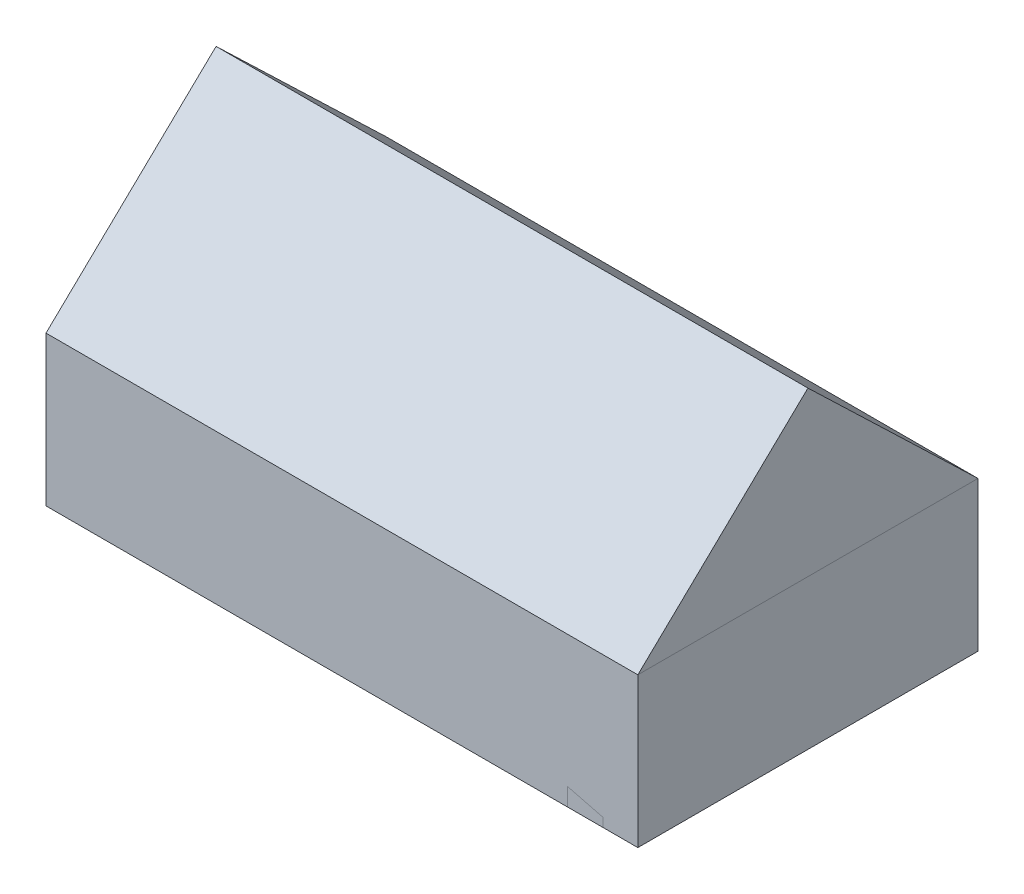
ISO-10303-21;
HEADER;
FILE_DESCRIPTION(('STEP AP214'),'2;1');
FILE_NAME('part.step','',(''),(''),'','','');
FILE_SCHEMA(('AUTOMOTIVE_DESIGN { 1 0 10303 214 1 1 1 1 }'));
ENDSEC;
DATA;
#1=APPLICATION_CONTEXT('core data for automotive mechanical design processes');
#2=APPLICATION_PROTOCOL_DEFINITION('international standard','automotive_design',2000,#1);
#3=PRODUCT_CONTEXT('',#1,'mechanical');
#4=PRODUCT('Part','Part','',(#3));
#5=PRODUCT_RELATED_PRODUCT_CATEGORY('part','',(#4));
#6=PRODUCT_DEFINITION_FORMATION('','',#4);
#7=PRODUCT_DEFINITION_CONTEXT('part definition',#1,'design');
#8=PRODUCT_DEFINITION('design','',#6,#7);
#9=PRODUCT_DEFINITION_SHAPE('','',#8);
#10=(LENGTH_UNIT() NAMED_UNIT(*) SI_UNIT(.MILLI.,.METRE.));
#11=(NAMED_UNIT(*) PLANE_ANGLE_UNIT() SI_UNIT($,.RADIAN.));
#12=(NAMED_UNIT(*) SI_UNIT($,.STERADIAN.) SOLID_ANGLE_UNIT());
#13=UNCERTAINTY_MEASURE_WITH_UNIT(LENGTH_MEASURE(1.E-05),#10,'distance_accuracy_value','');
#14=(GEOMETRIC_REPRESENTATION_CONTEXT(3) GLOBAL_UNCERTAINTY_ASSIGNED_CONTEXT((#13)) GLOBAL_UNIT_ASSIGNED_CONTEXT((#10,
#11,#12)) REPRESENTATION_CONTEXT('',''));
#15=CARTESIAN_POINT('',(0.,0.,0.));
#16=DIRECTION('',(0.,0.,1.));
#17=DIRECTION('',(1.,0.,0.));
#18=AXIS2_PLACEMENT_3D('',#15,#16,#17);
#19=CARTESIAN_POINT('',(-42.015735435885,-0.206431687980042,41.9999999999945));
#20=DIRECTION('',(0.,0.,-1.));
#21=DIRECTION('',(-1.,0.,0.));
#22=AXIS2_PLACEMENT_3D('',#19,#20,#21);
#23=PLANE('',#22);
#24=DIRECTION('',(0.,-1.,0.));
#25=VECTOR('',#24,1.);
#26=CARTESIAN_POINT('',(-43.515735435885,-0.206431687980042,41.9999999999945));
#27=LINE('',#26,#25);
#28=CARTESIAN_POINT('',(-43.515735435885,-0.206431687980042,41.9999999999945));
#29=VERTEX_POINT('',#28);
#30=CARTESIAN_POINT('',(-43.515735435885,-3.50643168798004,41.9999999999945));
#31=VERTEX_POINT('',#30);
#32=EDGE_CURVE('P0_E106',#29,#31,#27,.T.);
#33=ORIENTED_EDGE('',*,*,#32,.F.);
#34=DIRECTION('',(-1.,0.,0.));
#35=VECTOR('',#34,1.);
#36=CARTESIAN_POINT('',(-42.015735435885,-0.206431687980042,41.9999999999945));
#37=LINE('',#36,#35);
#38=CARTESIAN_POINT('',(-42.015735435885,-0.206431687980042,41.9999999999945));
#39=VERTEX_POINT('',#38);
#40=EDGE_CURVE('P0_E12',#39,#29,#37,.T.);
#41=ORIENTED_EDGE('',*,*,#40,.F.);
#42=DIRECTION('',(0.,-1.,0.));
#43=VECTOR('',#42,1.);
#44=CARTESIAN_POINT('',(-42.015735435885,-0.206431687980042,41.9999999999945));
#45=LINE('',#44,#43);
#46=CARTESIAN_POINT('',(-42.015735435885,-3.50643168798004,41.9999999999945));
#47=VERTEX_POINT('',#46);
#48=EDGE_CURVE('P0_E100',#39,#47,#45,.T.);
#49=ORIENTED_EDGE('',*,*,#48,.T.);
#50=DIRECTION('',(-1.,0.,0.));
#51=VECTOR('',#50,1.);
#52=CARTESIAN_POINT('',(-42.015735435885,-3.50643168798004,41.9999999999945));
#53=LINE('',#52,#51);
#54=EDGE_CURVE('P0_E45',#47,#31,#53,.T.);
#55=ORIENTED_EDGE('',*,*,#54,.T.);
#56=EDGE_LOOP('',(#33,#41,#49,#55));
#57=FACE_BOUND('',#56,.T.);
#58=ADVANCED_FACE('P0_F42',(#57),#23,.T.);
#59=CARTESIAN_POINT('',(-42.015735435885,-0.206431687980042,41.9999999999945));
#60=DIRECTION('',(0.,1.,0.));
#61=DIRECTION('',(0.,0.,1.));
#62=AXIS2_PLACEMENT_3D('',#59,#60,#61);
#63=PLANE('',#62);
#64=DIRECTION('',(0.,0.,-1.));
#65=VECTOR('',#64,1.);
#66=CARTESIAN_POINT('',(-43.515735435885,-0.206431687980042,41.9999999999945));
#67=LINE('',#66,#65);
#68=CARTESIAN_POINT('',(-43.515735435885,-0.206431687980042,44.9999999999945));
#69=VERTEX_POINT('',#68);
#70=EDGE_CURVE('P0_E102',#69,#29,#67,.T.);
#71=ORIENTED_EDGE('',*,*,#70,.F.);
#72=DIRECTION('',(-1.,0.,0.));
#73=VECTOR('',#72,1.);
#74=CARTESIAN_POINT('',(-42.015735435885,-0.206431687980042,44.9999999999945));
#75=LINE('',#74,#73);
#76=CARTESIAN_POINT('',(-42.015735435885,-0.206431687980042,44.9999999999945));
#77=VERTEX_POINT('',#76);
#78=EDGE_CURVE('P0_E51',#77,#69,#75,.T.);
#79=ORIENTED_EDGE('',*,*,#78,.F.);
#80=DIRECTION('',(0.,0.,-1.));
#81=VECTOR('',#80,1.);
#82=CARTESIAN_POINT('',(-42.015735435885,-0.206431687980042,41.9999999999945));
#83=LINE('',#82,#81);
#84=EDGE_CURVE('P0_E97',#77,#39,#83,.T.);
#85=ORIENTED_EDGE('',*,*,#84,.T.);
#86=ORIENTED_EDGE('',*,*,#40,.T.);
#87=EDGE_LOOP('',(#71,#79,#85,#86));
#88=FACE_BOUND('',#87,.T.);
#89=ADVANCED_FACE('P0_F116',(#88),#63,.T.);
#90=CARTESIAN_POINT('',(-42.015735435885,-0.206431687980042,44.9999999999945));
#91=DIRECTION('',(0.,0.,1.));
#92=DIRECTION('',(1.,0.,0.));
#93=AXIS2_PLACEMENT_3D('',#90,#91,#92);
#94=PLANE('',#93);
#95=DIRECTION('',(0.,1.,0.));
#96=VECTOR('',#95,1.);
#97=CARTESIAN_POINT('',(-43.515735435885,-0.206431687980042,44.9999999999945));
#98=LINE('',#97,#96);
#99=CARTESIAN_POINT('',(-43.515735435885,-3.50643168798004,44.9999999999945));
#100=VERTEX_POINT('',#99);
#101=EDGE_CURVE('P0_E92',#100,#69,#98,.T.);
#102=ORIENTED_EDGE('',*,*,#101,.F.);
#103=DIRECTION('',(-1.,0.,0.));
#104=VECTOR('',#103,1.);
#105=CARTESIAN_POINT('',(-42.015735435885,-3.50643168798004,44.9999999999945));
#106=LINE('',#105,#104);
#107=CARTESIAN_POINT('',(-42.015735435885,-3.50643168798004,44.9999999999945));
#108=VERTEX_POINT('',#107);
#109=EDGE_CURVE('P0_E87',#108,#100,#106,.T.);
#110=ORIENTED_EDGE('',*,*,#109,.F.);
#111=DIRECTION('',(0.,1.,0.));
#112=VECTOR('',#111,1.);
#113=CARTESIAN_POINT('',(-42.015735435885,-0.206431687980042,44.9999999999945));
#114=LINE('',#113,#112);
#115=EDGE_CURVE('P0_E90',#108,#77,#114,.T.);
#116=ORIENTED_EDGE('',*,*,#115,.T.);
#117=ORIENTED_EDGE('',*,*,#78,.T.);
#118=EDGE_LOOP('',(#102,#110,#116,#117));
#119=FACE_BOUND('',#118,.T.);
#120=ADVANCED_FACE('P0_F89',(#119),#94,.T.);
#121=CARTESIAN_POINT('',(-42.015735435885,-3.50643168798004,41.9999999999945));
#122=DIRECTION('',(0.,-1.,0.));
#123=DIRECTION('',(0.,0.,-1.));
#124=AXIS2_PLACEMENT_3D('',#121,#122,#123);
#125=PLANE('',#124);
#126=DIRECTION('',(0.,0.,1.));
#127=VECTOR('',#126,1.);
#128=CARTESIAN_POINT('',(-43.515735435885,-3.50643168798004,41.9999999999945));
#129=LINE('',#128,#127);
#130=EDGE_CURVE('P0_E109',#31,#100,#129,.T.);
#131=ORIENTED_EDGE('',*,*,#130,.F.);
#132=ORIENTED_EDGE('',*,*,#54,.F.);
#133=DIRECTION('',(0.,0.,1.));
#134=VECTOR('',#133,1.);
#135=CARTESIAN_POINT('',(-42.015735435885,-3.50643168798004,41.9999999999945));
#136=LINE('',#135,#134);
#137=EDGE_CURVE('P0_E96',#47,#108,#136,.T.);
#138=ORIENTED_EDGE('',*,*,#137,.T.);
#139=ORIENTED_EDGE('',*,*,#109,.T.);
#140=EDGE_LOOP('',(#131,#132,#138,#139));
#141=FACE_BOUND('',#140,.T.);
#142=ADVANCED_FACE('P0_F99',(#141),#125,.T.);
#143=CARTESIAN_POINT('',(-42.015735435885,-3.50643168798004,41.9999999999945));
#144=DIRECTION('',(-1.,0.,0.));
#145=DIRECTION('',(0.,0.,1.));
#146=AXIS2_PLACEMENT_3D('',#143,#144,#145);
#147=PLANE('',#146);
#148=ORIENTED_EDGE('',*,*,#48,.F.);
#149=ORIENTED_EDGE('',*,*,#84,.F.);
#150=ORIENTED_EDGE('',*,*,#115,.F.);
#151=ORIENTED_EDGE('',*,*,#137,.F.);
#152=EDGE_LOOP('',(#148,#149,#150,#151));
#153=FACE_BOUND('',#152,.T.);
#154=ADVANCED_FACE('P0_F95',(#153),#147,.F.);
#155=CARTESIAN_POINT('',(-43.515735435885,-3.50643168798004,41.9999999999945));
#156=DIRECTION('',(-1.,0.,0.));
#157=DIRECTION('',(0.,0.,1.));
#158=AXIS2_PLACEMENT_3D('',#155,#156,#157);
#159=PLANE('',#158);
#160=ORIENTED_EDGE('',*,*,#32,.T.);
#161=ORIENTED_EDGE('',*,*,#130,.T.);
#162=ORIENTED_EDGE('',*,*,#101,.T.);
#163=ORIENTED_EDGE('',*,*,#70,.T.);
#164=EDGE_LOOP('',(#160,#161,#162,#163));
#165=FACE_BOUND('',#164,.T.);
#166=ADVANCED_FACE('P0_F115',(#165),#159,.T.);
#167=CLOSED_SHELL('',(#58,#89,#120,#142,#154,#166));
#168=MANIFOLD_SOLID_BREP('P0_B2',#167);
#169=CARTESIAN_POINT('',(33.134264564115,-12.95643168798,66.9999999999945));
#170=DIRECTION('',(-1.,0.,0.));
#171=DIRECTION('',(0.,0.,1.));
#172=AXIS2_PLACEMENT_3D('',#169,#170,#171);
#173=PLANE('',#172);
#174=DIRECTION('',(0.,-1.,0.));
#175=VECTOR('',#174,1.);
#176=CARTESIAN_POINT('',(33.134264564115,-12.95643168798,68.4999999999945));
#177=LINE('',#176,#175);
#178=CARTESIAN_POINT('',(33.134264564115,-0.506431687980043,68.4999999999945));
#179=VERTEX_POINT('',#178);
#180=CARTESIAN_POINT('',(33.134264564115,-12.95643168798,68.4999999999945));
#181=VERTEX_POINT('',#180);
#182=EDGE_CURVE('P0_E240',#179,#181,#177,.T.);
#183=ORIENTED_EDGE('',*,*,#182,.F.);
#184=DIRECTION('',(0.,0.,1.));
#185=VECTOR('',#184,1.);
#186=CARTESIAN_POINT('',(33.134264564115,-0.506431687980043,66.9999999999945));
#187=LINE('',#186,#185);
#188=CARTESIAN_POINT('',(33.134264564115,-0.506431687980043,66.9999999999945));
#189=VERTEX_POINT('',#188);
#190=EDGE_CURVE('P0_E40',#189,#179,#187,.T.);
#191=ORIENTED_EDGE('',*,*,#190,.F.);
#192=DIRECTION('',(0.,-1.,0.));
#193=VECTOR('',#192,1.);
#194=CARTESIAN_POINT('',(33.134264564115,-12.95643168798,66.9999999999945));
#195=LINE('',#194,#193);
#196=CARTESIAN_POINT('',(33.134264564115,-12.95643168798,66.9999999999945));
#197=VERTEX_POINT('',#196);
#198=EDGE_CURVE('P0_E234',#189,#197,#195,.T.);
#199=ORIENTED_EDGE('',*,*,#198,.T.);
#200=DIRECTION('',(0.,0.,1.));
#201=VECTOR('',#200,1.);
#202=CARTESIAN_POINT('',(33.134264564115,-12.95643168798,66.9999999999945));
#203=LINE('',#202,#201);
#204=EDGE_CURVE('P0_E179',#197,#181,#203,.T.);
#205=ORIENTED_EDGE('',*,*,#204,.T.);
#206=EDGE_LOOP('',(#183,#191,#199,#205));
#207=FACE_BOUND('',#206,.T.);
#208=ADVANCED_FACE('P0_F176',(#207),#173,.T.);
#209=CARTESIAN_POINT('',(33.134264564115,-0.506431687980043,66.9999999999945));
#210=DIRECTION('',(0.,1.,0.));
#211=DIRECTION('',(0.,0.,1.));
#212=AXIS2_PLACEMENT_3D('',#209,#210,#211);
#213=PLANE('',#212);
#214=DIRECTION('',(-1.,0.,0.));
#215=VECTOR('',#214,1.);
#216=CARTESIAN_POINT('',(33.134264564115,-0.506431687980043,68.4999999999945));
#217=LINE('',#216,#215);
#218=CARTESIAN_POINT('',(38.384264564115,-0.506431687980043,68.4999999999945));
#219=VERTEX_POINT('',#218);
#220=EDGE_CURVE('P0_E236',#219,#179,#217,.T.);
#221=ORIENTED_EDGE('',*,*,#220,.F.);
#222=DIRECTION('',(0.,0.,1.));
#223=VECTOR('',#222,1.);
#224=CARTESIAN_POINT('',(38.384264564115,-0.506431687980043,66.9999999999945));
#225=LINE('',#224,#223);
#226=CARTESIAN_POINT('',(38.384264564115,-0.506431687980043,66.9999999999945));
#227=VERTEX_POINT('',#226);
#228=EDGE_CURVE('P0_E185',#227,#219,#225,.T.);
#229=ORIENTED_EDGE('',*,*,#228,.F.);
#230=DIRECTION('',(-1.,0.,0.));
#231=VECTOR('',#230,1.);
#232=CARTESIAN_POINT('',(33.134264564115,-0.506431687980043,66.9999999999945));
#233=LINE('',#232,#231);
#234=EDGE_CURVE('P0_E231',#227,#189,#233,.T.);
#235=ORIENTED_EDGE('',*,*,#234,.T.);
#236=ORIENTED_EDGE('',*,*,#190,.T.);
#237=EDGE_LOOP('',(#221,#229,#235,#236));
#238=FACE_BOUND('',#237,.T.);
#239=ADVANCED_FACE('P0_F250',(#238),#213,.T.);
#240=CARTESIAN_POINT('',(38.384264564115,-12.95643168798,66.9999999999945));
#241=DIRECTION('',(1.,0.,0.));
#242=DIRECTION('',(0.,0.,-1.));
#243=AXIS2_PLACEMENT_3D('',#240,#241,#242);
#244=PLANE('',#243);
#245=DIRECTION('',(0.,1.,0.));
#246=VECTOR('',#245,1.);
#247=CARTESIAN_POINT('',(38.384264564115,-12.95643168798,68.4999999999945));
#248=LINE('',#247,#246);
#249=CARTESIAN_POINT('',(38.384264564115,-12.95643168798,68.4999999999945));
#250=VERTEX_POINT('',#249);
#251=EDGE_CURVE('P0_E226',#250,#219,#248,.T.);
#252=ORIENTED_EDGE('',*,*,#251,.F.);
#253=DIRECTION('',(0.,0.,1.));
#254=VECTOR('',#253,1.);
#255=CARTESIAN_POINT('',(38.384264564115,-12.95643168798,66.9999999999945));
#256=LINE('',#255,#254);
#257=CARTESIAN_POINT('',(38.384264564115,-12.95643168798,66.9999999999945));
#258=VERTEX_POINT('',#257);
#259=EDGE_CURVE('P0_E221',#258,#250,#256,.T.);
#260=ORIENTED_EDGE('',*,*,#259,.F.);
#261=DIRECTION('',(0.,1.,0.));
#262=VECTOR('',#261,1.);
#263=CARTESIAN_POINT('',(38.384264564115,-12.95643168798,66.9999999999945));
#264=LINE('',#263,#262);
#265=EDGE_CURVE('P0_E224',#258,#227,#264,.T.);
#266=ORIENTED_EDGE('',*,*,#265,.T.);
#267=ORIENTED_EDGE('',*,*,#228,.T.);
#268=EDGE_LOOP('',(#252,#260,#266,#267));
#269=FACE_BOUND('',#268,.T.);
#270=ADVANCED_FACE('P0_F223',(#269),#244,.T.);
#271=CARTESIAN_POINT('',(33.134264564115,-12.95643168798,66.9999999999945));
#272=DIRECTION('',(0.,-1.,0.));
#273=DIRECTION('',(0.,0.,-1.));
#274=AXIS2_PLACEMENT_3D('',#271,#272,#273);
#275=PLANE('',#274);
#276=DIRECTION('',(1.,0.,0.));
#277=VECTOR('',#276,1.);
#278=CARTESIAN_POINT('',(33.134264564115,-12.95643168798,68.4999999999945));
#279=LINE('',#278,#277);
#280=EDGE_CURVE('P0_E243',#181,#250,#279,.T.);
#281=ORIENTED_EDGE('',*,*,#280,.F.);
#282=ORIENTED_EDGE('',*,*,#204,.F.);
#283=DIRECTION('',(1.,0.,0.));
#284=VECTOR('',#283,1.);
#285=CARTESIAN_POINT('',(33.134264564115,-12.95643168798,66.9999999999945));
#286=LINE('',#285,#284);
#287=EDGE_CURVE('P0_E230',#197,#258,#286,.T.);
#288=ORIENTED_EDGE('',*,*,#287,.T.);
#289=ORIENTED_EDGE('',*,*,#259,.T.);
#290=EDGE_LOOP('',(#281,#282,#288,#289));
#291=FACE_BOUND('',#290,.T.);
#292=ADVANCED_FACE('P0_F233',(#291),#275,.T.);
#293=CARTESIAN_POINT('',(33.134264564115,-0.506431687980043,66.9999999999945));
#294=DIRECTION('',(0.,0.,-1.));
#295=DIRECTION('',(-1.,0.,0.));
#296=AXIS2_PLACEMENT_3D('',#293,#294,#295);
#297=PLANE('',#296);
#298=ORIENTED_EDGE('',*,*,#198,.F.);
#299=ORIENTED_EDGE('',*,*,#234,.F.);
#300=ORIENTED_EDGE('',*,*,#265,.F.);
#301=ORIENTED_EDGE('',*,*,#287,.F.);
#302=EDGE_LOOP('',(#298,#299,#300,#301));
#303=FACE_BOUND('',#302,.T.);
#304=ADVANCED_FACE('P0_F229',(#303),#297,.T.);
#305=CARTESIAN_POINT('',(33.134264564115,-0.506431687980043,68.4999999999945));
#306=DIRECTION('',(0.,0.,-1.));
#307=DIRECTION('',(-1.,0.,0.));
#308=AXIS2_PLACEMENT_3D('',#305,#306,#307);
#309=PLANE('',#308);
#310=ORIENTED_EDGE('',*,*,#182,.T.);
#311=ORIENTED_EDGE('',*,*,#280,.T.);
#312=ORIENTED_EDGE('',*,*,#251,.T.);
#313=ORIENTED_EDGE('',*,*,#220,.T.);
#314=EDGE_LOOP('',(#310,#311,#312,#313));
#315=FACE_BOUND('',#314,.T.);
#316=ADVANCED_FACE('P0_F249',(#315),#309,.F.);
#317=CLOSED_SHELL('',(#208,#239,#270,#292,#304,#316));
#318=MANIFOLD_SOLID_BREP('P0_B6',#317);
#319=CARTESIAN_POINT('',(16.334264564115,-0.506431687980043,66.9999999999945));
#320=DIRECTION('',(-1.,0.,0.));
#321=DIRECTION('',(0.,0.,1.));
#322=AXIS2_PLACEMENT_3D('',#319,#320,#321);
#323=PLANE('',#322);
#324=DIRECTION('',(0.,-1.,0.));
#325=VECTOR('',#324,1.);
#326=CARTESIAN_POINT('',(16.334264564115,-0.506431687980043,68.4999999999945));
#327=LINE('',#326,#325);
#328=CARTESIAN_POINT('',(16.334264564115,-0.506431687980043,68.4999999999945));
#329=VERTEX_POINT('',#328);
#330=CARTESIAN_POINT('',(16.334264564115,-7.25643168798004,68.4999999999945));
#331=VERTEX_POINT('',#330);
#332=EDGE_CURVE('P0_E374',#329,#331,#327,.T.);
#333=ORIENTED_EDGE('',*,*,#332,.F.);
#334=DIRECTION('',(0.,0.,1.));
#335=VECTOR('',#334,1.);
#336=CARTESIAN_POINT('',(16.334264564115,-0.506431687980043,66.9999999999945));
#337=LINE('',#336,#335);
#338=CARTESIAN_POINT('',(16.334264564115,-0.506431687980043,66.9999999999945));
#339=VERTEX_POINT('',#338);
#340=EDGE_CURVE('P0_E174',#339,#329,#337,.T.);
#341=ORIENTED_EDGE('',*,*,#340,.F.);
#342=DIRECTION('',(0.,-1.,0.));
#343=VECTOR('',#342,1.);
#344=CARTESIAN_POINT('',(16.334264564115,-0.506431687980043,66.9999999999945));
#345=LINE('',#344,#343);
#346=CARTESIAN_POINT('',(16.334264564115,-7.25643168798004,66.9999999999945));
#347=VERTEX_POINT('',#346);
#348=EDGE_CURVE('P0_E368',#339,#347,#345,.T.);
#349=ORIENTED_EDGE('',*,*,#348,.T.);
#350=DIRECTION('',(0.,0.,1.));
#351=VECTOR('',#350,1.);
#352=CARTESIAN_POINT('',(16.334264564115,-7.25643168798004,66.9999999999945));
#353=LINE('',#352,#351);
#354=EDGE_CURVE('P0_E313',#347,#331,#353,.T.);
#355=ORIENTED_EDGE('',*,*,#354,.T.);
#356=EDGE_LOOP('',(#333,#341,#349,#355));
#357=FACE_BOUND('',#356,.T.);
#358=ADVANCED_FACE('P0_F310',(#357),#323,.T.);
#359=CARTESIAN_POINT('',(16.334264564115,-0.506431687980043,66.9999999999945));
#360=DIRECTION('',(0.,1.,0.));
#361=DIRECTION('',(-1.,0.,0.));
#362=AXIS2_PLACEMENT_3D('',#359,#360,#361);
#363=PLANE('',#362);
#364=DIRECTION('',(-1.,0.,0.));
#365=VECTOR('',#364,1.);
#366=CARTESIAN_POINT('',(16.334264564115,-0.506431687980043,68.4999999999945));
#367=LINE('',#366,#365);
#368=CARTESIAN_POINT('',(22.334264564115,-0.506431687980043,68.4999999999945));
#369=VERTEX_POINT('',#368);
#370=EDGE_CURVE('P0_E370',#369,#329,#367,.T.);
#371=ORIENTED_EDGE('',*,*,#370,.F.);
#372=DIRECTION('',(0.,0.,1.));
#373=VECTOR('',#372,1.);
#374=CARTESIAN_POINT('',(22.334264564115,-0.506431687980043,66.9999999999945));
#375=LINE('',#374,#373);
#376=CARTESIAN_POINT('',(22.334264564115,-0.506431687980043,66.9999999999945));
#377=VERTEX_POINT('',#376);
#378=EDGE_CURVE('P0_E319',#377,#369,#375,.T.);
#379=ORIENTED_EDGE('',*,*,#378,.F.);
#380=DIRECTION('',(-1.,0.,0.));
#381=VECTOR('',#380,1.);
#382=CARTESIAN_POINT('',(16.334264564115,-0.506431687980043,66.9999999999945));
#383=LINE('',#382,#381);
#384=EDGE_CURVE('P0_E365',#377,#339,#383,.T.);
#385=ORIENTED_EDGE('',*,*,#384,.T.);
#386=ORIENTED_EDGE('',*,*,#340,.T.);
#387=EDGE_LOOP('',(#371,#379,#385,#386));
#388=FACE_BOUND('',#387,.T.);
#389=ADVANCED_FACE('P0_F384',(#388),#363,.T.);
#390=CARTESIAN_POINT('',(22.334264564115,-0.506431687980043,66.9999999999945));
#391=DIRECTION('',(1.,0.,0.));
#392=DIRECTION('',(0.,0.,-1.));
#393=AXIS2_PLACEMENT_3D('',#390,#391,#392);
#394=PLANE('',#393);
#395=DIRECTION('',(0.,1.,0.));
#396=VECTOR('',#395,1.);
#397=CARTESIAN_POINT('',(22.334264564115,-0.506431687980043,68.4999999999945));
#398=LINE('',#397,#396);
#399=CARTESIAN_POINT('',(22.334264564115,-7.25643168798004,68.4999999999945));
#400=VERTEX_POINT('',#399);
#401=EDGE_CURVE('P0_E360',#400,#369,#398,.T.);
#402=ORIENTED_EDGE('',*,*,#401,.F.);
#403=DIRECTION('',(0.,0.,1.));
#404=VECTOR('',#403,1.);
#405=CARTESIAN_POINT('',(22.334264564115,-7.25643168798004,66.9999999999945));
#406=LINE('',#405,#404);
#407=CARTESIAN_POINT('',(22.334264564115,-7.25643168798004,66.9999999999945));
#408=VERTEX_POINT('',#407);
#409=EDGE_CURVE('P0_E355',#408,#400,#406,.T.);
#410=ORIENTED_EDGE('',*,*,#409,.F.);
#411=DIRECTION('',(0.,1.,0.));
#412=VECTOR('',#411,1.);
#413=CARTESIAN_POINT('',(22.334264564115,-0.506431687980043,66.9999999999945));
#414=LINE('',#413,#412);
#415=EDGE_CURVE('P0_E358',#408,#377,#414,.T.);
#416=ORIENTED_EDGE('',*,*,#415,.T.);
#417=ORIENTED_EDGE('',*,*,#378,.T.);
#418=EDGE_LOOP('',(#402,#410,#416,#417));
#419=FACE_BOUND('',#418,.T.);
#420=ADVANCED_FACE('P0_F357',(#419),#394,.T.);
#421=CARTESIAN_POINT('',(16.334264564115,-7.25643168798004,66.9999999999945));
#422=DIRECTION('',(0.,-1.,0.));
#423=DIRECTION('',(1.,0.,0.));
#424=AXIS2_PLACEMENT_3D('',#421,#422,#423);
#425=PLANE('',#424);
#426=DIRECTION('',(1.,0.,0.));
#427=VECTOR('',#426,1.);
#428=CARTESIAN_POINT('',(16.334264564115,-7.25643168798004,68.4999999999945));
#429=LINE('',#428,#427);
#430=EDGE_CURVE('P0_E377',#331,#400,#429,.T.);
#431=ORIENTED_EDGE('',*,*,#430,.F.);
#432=ORIENTED_EDGE('',*,*,#354,.F.);
#433=DIRECTION('',(1.,0.,0.));
#434=VECTOR('',#433,1.);
#435=CARTESIAN_POINT('',(16.334264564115,-7.25643168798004,66.9999999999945));
#436=LINE('',#435,#434);
#437=EDGE_CURVE('P0_E364',#347,#408,#436,.T.);
#438=ORIENTED_EDGE('',*,*,#437,.T.);
#439=ORIENTED_EDGE('',*,*,#409,.T.);
#440=EDGE_LOOP('',(#431,#432,#438,#439));
#441=FACE_BOUND('',#440,.T.);
#442=ADVANCED_FACE('P0_F367',(#441),#425,.T.);
#443=CARTESIAN_POINT('',(16.334264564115,-0.506431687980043,66.9999999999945));
#444=DIRECTION('',(0.,0.,1.));
#445=DIRECTION('',(1.,0.,0.));
#446=AXIS2_PLACEMENT_3D('',#443,#444,#445);
#447=PLANE('',#446);
#448=ORIENTED_EDGE('',*,*,#348,.F.);
#449=ORIENTED_EDGE('',*,*,#384,.F.);
#450=ORIENTED_EDGE('',*,*,#415,.F.);
#451=ORIENTED_EDGE('',*,*,#437,.F.);
#452=EDGE_LOOP('',(#448,#449,#450,#451));
#453=FACE_BOUND('',#452,.T.);
#454=ADVANCED_FACE('P0_F363',(#453),#447,.F.);
#455=CARTESIAN_POINT('',(16.334264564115,-0.506431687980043,68.4999999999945));
#456=DIRECTION('',(0.,0.,1.));
#457=DIRECTION('',(1.,0.,0.));
#458=AXIS2_PLACEMENT_3D('',#455,#456,#457);
#459=PLANE('',#458);
#460=ORIENTED_EDGE('',*,*,#332,.T.);
#461=ORIENTED_EDGE('',*,*,#430,.T.);
#462=ORIENTED_EDGE('',*,*,#401,.T.);
#463=ORIENTED_EDGE('',*,*,#370,.T.);
#464=EDGE_LOOP('',(#460,#461,#462,#463));
#465=FACE_BOUND('',#464,.T.);
#466=ADVANCED_FACE('P0_F383',(#465),#459,.T.);
#467=CLOSED_SHELL('',(#358,#389,#420,#442,#454,#466));
#468=MANIFOLD_SOLID_BREP('P0_B34',#467);
#469=CARTESIAN_POINT('',(-20.1140567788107,-0.356431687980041,66.9999999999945));
#470=DIRECTION('',(-1.,0.,0.));
#471=DIRECTION('',(0.,0.,1.));
#472=AXIS2_PLACEMENT_3D('',#469,#470,#471);
#473=PLANE('',#472);
#474=DIRECTION('',(0.,-1.,0.));
#475=VECTOR('',#474,1.);
#476=CARTESIAN_POINT('',(-20.1140567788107,-0.356431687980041,68.4999999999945));
#477=LINE('',#476,#475);
#478=CARTESIAN_POINT('',(-20.1140567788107,-0.356431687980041,68.4999999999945));
#479=VERTEX_POINT('',#478);
#480=CARTESIAN_POINT('',(-20.1140567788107,-3.65643168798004,68.4999999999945));
#481=VERTEX_POINT('',#480);
#482=EDGE_CURVE('P0_E508',#479,#481,#477,.T.);
#483=ORIENTED_EDGE('',*,*,#482,.F.);
#484=DIRECTION('',(0.,0.,1.));
#485=VECTOR('',#484,1.);
#486=CARTESIAN_POINT('',(-20.1140567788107,-0.356431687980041,66.9999999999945));
#487=LINE('',#486,#485);
#488=CARTESIAN_POINT('',(-20.1140567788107,-0.356431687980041,66.9999999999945));
#489=VERTEX_POINT('',#488);
#490=EDGE_CURVE('P0_E308',#489,#479,#487,.T.);
#491=ORIENTED_EDGE('',*,*,#490,.F.);
#492=DIRECTION('',(0.,-1.,0.));
#493=VECTOR('',#492,1.);
#494=CARTESIAN_POINT('',(-20.1140567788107,-0.356431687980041,66.9999999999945));
#495=LINE('',#494,#493);
#496=CARTESIAN_POINT('',(-20.1140567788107,-3.65643168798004,66.9999999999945));
#497=VERTEX_POINT('',#496);
#498=EDGE_CURVE('P0_E502',#489,#497,#495,.T.);
#499=ORIENTED_EDGE('',*,*,#498,.T.);
#500=DIRECTION('',(0.,0.,1.));
#501=VECTOR('',#500,1.);
#502=CARTESIAN_POINT('',(-20.1140567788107,-3.65643168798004,66.9999999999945));
#503=LINE('',#502,#501);
#504=EDGE_CURVE('P0_E447',#497,#481,#503,.T.);
#505=ORIENTED_EDGE('',*,*,#504,.T.);
#506=EDGE_LOOP('',(#483,#491,#499,#505));
#507=FACE_BOUND('',#506,.T.);
#508=ADVANCED_FACE('P0_F444',(#507),#473,.T.);
#509=CARTESIAN_POINT('',(-20.1140567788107,-0.356431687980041,66.9999999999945));
#510=DIRECTION('',(0.,1.,0.));
#511=DIRECTION('',(0.,0.,1.));
#512=AXIS2_PLACEMENT_3D('',#509,#510,#511);
#513=PLANE('',#512);
#514=DIRECTION('',(-1.,0.,0.));
#515=VECTOR('',#514,1.);
#516=CARTESIAN_POINT('',(-20.1140567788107,-0.356431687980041,68.4999999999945));
#517=LINE('',#516,#515);
#518=CARTESIAN_POINT('',(-14.5640567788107,-0.356431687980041,68.4999999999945));
#519=VERTEX_POINT('',#518);
#520=EDGE_CURVE('P0_E504',#519,#479,#517,.T.);
#521=ORIENTED_EDGE('',*,*,#520,.F.);
#522=DIRECTION('',(0.,0.,1.));
#523=VECTOR('',#522,1.);
#524=CARTESIAN_POINT('',(-14.5640567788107,-0.356431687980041,66.9999999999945));
#525=LINE('',#524,#523);
#526=CARTESIAN_POINT('',(-14.5640567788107,-0.356431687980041,66.9999999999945));
#527=VERTEX_POINT('',#526);
#528=EDGE_CURVE('P0_E453',#527,#519,#525,.T.);
#529=ORIENTED_EDGE('',*,*,#528,.F.);
#530=DIRECTION('',(-1.,0.,0.));
#531=VECTOR('',#530,1.);
#532=CARTESIAN_POINT('',(-20.1140567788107,-0.356431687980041,66.9999999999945));
#533=LINE('',#532,#531);
#534=EDGE_CURVE('P0_E499',#527,#489,#533,.T.);
#535=ORIENTED_EDGE('',*,*,#534,.T.);
#536=ORIENTED_EDGE('',*,*,#490,.T.);
#537=EDGE_LOOP('',(#521,#529,#535,#536));
#538=FACE_BOUND('',#537,.T.);
#539=ADVANCED_FACE('P0_F518',(#538),#513,.T.);
#540=CARTESIAN_POINT('',(-14.5640567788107,-0.356431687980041,66.9999999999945));
#541=DIRECTION('',(1.,0.,0.));
#542=DIRECTION('',(0.,0.,-1.));
#543=AXIS2_PLACEMENT_3D('',#540,#541,#542);
#544=PLANE('',#543);
#545=DIRECTION('',(0.,1.,0.));
#546=VECTOR('',#545,1.);
#547=CARTESIAN_POINT('',(-14.5640567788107,-0.356431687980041,68.4999999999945));
#548=LINE('',#547,#546);
#549=CARTESIAN_POINT('',(-14.5640567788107,-3.65643168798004,68.4999999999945));
#550=VERTEX_POINT('',#549);
#551=EDGE_CURVE('P0_E494',#550,#519,#548,.T.);
#552=ORIENTED_EDGE('',*,*,#551,.F.);
#553=DIRECTION('',(0.,0.,1.));
#554=VECTOR('',#553,1.);
#555=CARTESIAN_POINT('',(-14.5640567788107,-3.65643168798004,66.9999999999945));
#556=LINE('',#555,#554);
#557=CARTESIAN_POINT('',(-14.5640567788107,-3.65643168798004,66.9999999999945));
#558=VERTEX_POINT('',#557);
#559=EDGE_CURVE('P0_E489',#558,#550,#556,.T.);
#560=ORIENTED_EDGE('',*,*,#559,.F.);
#561=DIRECTION('',(0.,1.,0.));
#562=VECTOR('',#561,1.);
#563=CARTESIAN_POINT('',(-14.5640567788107,-0.356431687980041,66.9999999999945));
#564=LINE('',#563,#562);
#565=EDGE_CURVE('P0_E492',#558,#527,#564,.T.);
#566=ORIENTED_EDGE('',*,*,#565,.T.);
#567=ORIENTED_EDGE('',*,*,#528,.T.);
#568=EDGE_LOOP('',(#552,#560,#566,#567));
#569=FACE_BOUND('',#568,.T.);
#570=ADVANCED_FACE('P0_F491',(#569),#544,.T.);
#571=CARTESIAN_POINT('',(-20.1140567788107,-3.65643168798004,66.9999999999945));
#572=DIRECTION('',(0.,-1.,0.));
#573=DIRECTION('',(0.,0.,-1.));
#574=AXIS2_PLACEMENT_3D('',#571,#572,#573);
#575=PLANE('',#574);
#576=DIRECTION('',(1.,0.,0.));
#577=VECTOR('',#576,1.);
#578=CARTESIAN_POINT('',(-20.1140567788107,-3.65643168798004,68.4999999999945));
#579=LINE('',#578,#577);
#580=EDGE_CURVE('P0_E511',#481,#550,#579,.T.);
#581=ORIENTED_EDGE('',*,*,#580,.F.);
#582=ORIENTED_EDGE('',*,*,#504,.F.);
#583=DIRECTION('',(1.,0.,0.));
#584=VECTOR('',#583,1.);
#585=CARTESIAN_POINT('',(-20.1140567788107,-3.65643168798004,66.9999999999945));
#586=LINE('',#585,#584);
#587=EDGE_CURVE('P0_E498',#497,#558,#586,.T.);
#588=ORIENTED_EDGE('',*,*,#587,.T.);
#589=ORIENTED_EDGE('',*,*,#559,.T.);
#590=EDGE_LOOP('',(#581,#582,#588,#589));
#591=FACE_BOUND('',#590,.T.);
#592=ADVANCED_FACE('P0_F501',(#591),#575,.T.);
#593=CARTESIAN_POINT('',(-20.1140567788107,-3.65643168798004,66.9999999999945));
#594=DIRECTION('',(0.,0.,1.));
#595=DIRECTION('',(1.,0.,0.));
#596=AXIS2_PLACEMENT_3D('',#593,#594,#595);
#597=PLANE('',#596);
#598=ORIENTED_EDGE('',*,*,#498,.F.);
#599=ORIENTED_EDGE('',*,*,#534,.F.);
#600=ORIENTED_EDGE('',*,*,#565,.F.);
#601=ORIENTED_EDGE('',*,*,#587,.F.);
#602=EDGE_LOOP('',(#598,#599,#600,#601));
#603=FACE_BOUND('',#602,.T.);
#604=ADVANCED_FACE('P0_F497',(#603),#597,.F.);
#605=CARTESIAN_POINT('',(-20.1140567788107,-3.65643168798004,68.4999999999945));
#606=DIRECTION('',(0.,0.,1.));
#607=DIRECTION('',(1.,0.,0.));
#608=AXIS2_PLACEMENT_3D('',#605,#606,#607);
#609=PLANE('',#608);
#610=ORIENTED_EDGE('',*,*,#482,.T.);
#611=ORIENTED_EDGE('',*,*,#580,.T.);
#612=ORIENTED_EDGE('',*,*,#551,.T.);
#613=ORIENTED_EDGE('',*,*,#520,.T.);
#614=EDGE_LOOP('',(#610,#611,#612,#613));
#615=FACE_BOUND('',#614,.T.);
#616=ADVANCED_FACE('P0_F517',(#615),#609,.T.);
#617=CLOSED_SHELL('',(#508,#539,#570,#592,#604,#616));
#618=MANIFOLD_SOLID_BREP('P0_B168',#617);
#619=CARTESIAN_POINT('',(-38.115735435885,-0.506431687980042,66.9999999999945));
#620=DIRECTION('',(-1.,0.,0.));
#621=DIRECTION('',(0.,0.,1.));
#622=AXIS2_PLACEMENT_3D('',#619,#620,#621);
#623=PLANE('',#622);
#624=DIRECTION('',(0.,-1.,0.));
#625=VECTOR('',#624,1.);
#626=CARTESIAN_POINT('',(-38.115735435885,-0.506431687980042,68.4999999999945));
#627=LINE('',#626,#625);
#628=CARTESIAN_POINT('',(-38.115735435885,-0.506431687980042,68.4999999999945));
#629=VERTEX_POINT('',#628);
#630=CARTESIAN_POINT('',(-38.115735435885,-7.25643168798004,68.4999999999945));
#631=VERTEX_POINT('',#630);
#632=EDGE_CURVE('P0_E642',#629,#631,#627,.T.);
#633=ORIENTED_EDGE('',*,*,#632,.F.);
#634=DIRECTION('',(0.,0.,1.));
#635=VECTOR('',#634,1.);
#636=CARTESIAN_POINT('',(-38.115735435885,-0.506431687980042,66.9999999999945));
#637=LINE('',#636,#635);
#638=CARTESIAN_POINT('',(-38.115735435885,-0.506431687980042,66.9999999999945));
#639=VERTEX_POINT('',#638);
#640=EDGE_CURVE('P0_E442',#639,#629,#637,.T.);
#641=ORIENTED_EDGE('',*,*,#640,.F.);
#642=DIRECTION('',(0.,-1.,0.));
#643=VECTOR('',#642,1.);
#644=CARTESIAN_POINT('',(-38.115735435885,-0.506431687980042,66.9999999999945));
#645=LINE('',#644,#643);
#646=CARTESIAN_POINT('',(-38.115735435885,-7.25643168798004,66.9999999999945));
#647=VERTEX_POINT('',#646);
#648=EDGE_CURVE('P0_E636',#639,#647,#645,.T.);
#649=ORIENTED_EDGE('',*,*,#648,.T.);
#650=DIRECTION('',(0.,0.,1.));
#651=VECTOR('',#650,1.);
#652=CARTESIAN_POINT('',(-38.115735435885,-7.25643168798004,66.9999999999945));
#653=LINE('',#652,#651);
#654=EDGE_CURVE('P0_E581',#647,#631,#653,.T.);
#655=ORIENTED_EDGE('',*,*,#654,.T.);
#656=EDGE_LOOP('',(#633,#641,#649,#655));
#657=FACE_BOUND('',#656,.T.);
#658=ADVANCED_FACE('P0_F578',(#657),#623,.T.);
#659=CARTESIAN_POINT('',(-38.115735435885,-0.506431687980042,66.9999999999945));
#660=DIRECTION('',(0.,1.,0.));
#661=DIRECTION('',(0.,0.,1.));
#662=AXIS2_PLACEMENT_3D('',#659,#660,#661);
#663=PLANE('',#662);
#664=DIRECTION('',(-1.,0.,0.));
#665=VECTOR('',#664,1.);
#666=CARTESIAN_POINT('',(-38.115735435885,-0.506431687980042,68.4999999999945));
#667=LINE('',#666,#665);
#668=CARTESIAN_POINT('',(-32.115735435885,-0.506431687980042,68.4999999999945));
#669=VERTEX_POINT('',#668);
#670=EDGE_CURVE('P0_E638',#669,#629,#667,.T.);
#671=ORIENTED_EDGE('',*,*,#670,.F.);
#672=DIRECTION('',(0.,0.,1.));
#673=VECTOR('',#672,1.);
#674=CARTESIAN_POINT('',(-32.115735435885,-0.506431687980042,66.9999999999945));
#675=LINE('',#674,#673);
#676=CARTESIAN_POINT('',(-32.115735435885,-0.506431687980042,66.9999999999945));
#677=VERTEX_POINT('',#676);
#678=EDGE_CURVE('P0_E587',#677,#669,#675,.T.);
#679=ORIENTED_EDGE('',*,*,#678,.F.);
#680=DIRECTION('',(-1.,0.,0.));
#681=VECTOR('',#680,1.);
#682=CARTESIAN_POINT('',(-38.115735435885,-0.506431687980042,66.9999999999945));
#683=LINE('',#682,#681);
#684=EDGE_CURVE('P0_E633',#677,#639,#683,.T.);
#685=ORIENTED_EDGE('',*,*,#684,.T.);
#686=ORIENTED_EDGE('',*,*,#640,.T.);
#687=EDGE_LOOP('',(#671,#679,#685,#686));
#688=FACE_BOUND('',#687,.T.);
#689=ADVANCED_FACE('P0_F652',(#688),#663,.T.);
#690=CARTESIAN_POINT('',(-32.115735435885,-0.506431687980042,66.9999999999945));
#691=DIRECTION('',(1.,0.,0.));
#692=DIRECTION('',(0.,0.,-1.));
#693=AXIS2_PLACEMENT_3D('',#690,#691,#692);
#694=PLANE('',#693);
#695=DIRECTION('',(0.,1.,0.));
#696=VECTOR('',#695,1.);
#697=CARTESIAN_POINT('',(-32.115735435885,-0.506431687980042,68.4999999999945));
#698=LINE('',#697,#696);
#699=CARTESIAN_POINT('',(-32.115735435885,-7.25643168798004,68.4999999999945));
#700=VERTEX_POINT('',#699);
#701=EDGE_CURVE('P0_E628',#700,#669,#698,.T.);
#702=ORIENTED_EDGE('',*,*,#701,.F.);
#703=DIRECTION('',(0.,0.,1.));
#704=VECTOR('',#703,1.);
#705=CARTESIAN_POINT('',(-32.115735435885,-7.25643168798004,66.9999999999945));
#706=LINE('',#705,#704);
#707=CARTESIAN_POINT('',(-32.115735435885,-7.25643168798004,66.9999999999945));
#708=VERTEX_POINT('',#707);
#709=EDGE_CURVE('P0_E623',#708,#700,#706,.T.);
#710=ORIENTED_EDGE('',*,*,#709,.F.);
#711=DIRECTION('',(0.,1.,0.));
#712=VECTOR('',#711,1.);
#713=CARTESIAN_POINT('',(-32.115735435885,-0.506431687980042,66.9999999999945));
#714=LINE('',#713,#712);
#715=EDGE_CURVE('P0_E626',#708,#677,#714,.T.);
#716=ORIENTED_EDGE('',*,*,#715,.T.);
#717=ORIENTED_EDGE('',*,*,#678,.T.);
#718=EDGE_LOOP('',(#702,#710,#716,#717));
#719=FACE_BOUND('',#718,.T.);
#720=ADVANCED_FACE('P0_F625',(#719),#694,.T.);
#721=CARTESIAN_POINT('',(-38.115735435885,-7.25643168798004,66.9999999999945));
#722=DIRECTION('',(0.,-1.,0.));
#723=DIRECTION('',(0.,0.,-1.));
#724=AXIS2_PLACEMENT_3D('',#721,#722,#723);
#725=PLANE('',#724);
#726=DIRECTION('',(1.,0.,0.));
#727=VECTOR('',#726,1.);
#728=CARTESIAN_POINT('',(-38.115735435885,-7.25643168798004,68.4999999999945));
#729=LINE('',#728,#727);
#730=EDGE_CURVE('P0_E645',#631,#700,#729,.T.);
#731=ORIENTED_EDGE('',*,*,#730,.F.);
#732=ORIENTED_EDGE('',*,*,#654,.F.);
#733=DIRECTION('',(1.,0.,0.));
#734=VECTOR('',#733,1.);
#735=CARTESIAN_POINT('',(-38.115735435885,-7.25643168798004,66.9999999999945));
#736=LINE('',#735,#734);
#737=EDGE_CURVE('P0_E632',#647,#708,#736,.T.);
#738=ORIENTED_EDGE('',*,*,#737,.T.);
#739=ORIENTED_EDGE('',*,*,#709,.T.);
#740=EDGE_LOOP('',(#731,#732,#738,#739));
#741=FACE_BOUND('',#740,.T.);
#742=ADVANCED_FACE('P0_F635',(#741),#725,.T.);
#743=CARTESIAN_POINT('',(-38.115735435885,-7.25643168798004,66.9999999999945));
#744=DIRECTION('',(0.,0.,1.));
#745=DIRECTION('',(1.,0.,0.));
#746=AXIS2_PLACEMENT_3D('',#743,#744,#745);
#747=PLANE('',#746);
#748=ORIENTED_EDGE('',*,*,#648,.F.);
#749=ORIENTED_EDGE('',*,*,#684,.F.);
#750=ORIENTED_EDGE('',*,*,#715,.F.);
#751=ORIENTED_EDGE('',*,*,#737,.F.);
#752=EDGE_LOOP('',(#748,#749,#750,#751));
#753=FACE_BOUND('',#752,.T.);
#754=ADVANCED_FACE('P0_F631',(#753),#747,.F.);
#755=CARTESIAN_POINT('',(-38.115735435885,-7.25643168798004,68.4999999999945));
#756=DIRECTION('',(0.,0.,1.));
#757=DIRECTION('',(1.,0.,0.));
#758=AXIS2_PLACEMENT_3D('',#755,#756,#757);
#759=PLANE('',#758);
#760=ORIENTED_EDGE('',*,*,#632,.T.);
#761=ORIENTED_EDGE('',*,*,#730,.T.);
#762=ORIENTED_EDGE('',*,*,#701,.T.);
#763=ORIENTED_EDGE('',*,*,#670,.T.);
#764=EDGE_LOOP('',(#760,#761,#762,#763));
#765=FACE_BOUND('',#764,.T.);
#766=ADVANCED_FACE('P0_F651',(#765),#759,.T.);
#767=CLOSED_SHELL('',(#658,#689,#720,#742,#754,#766));
#768=MANIFOLD_SOLID_BREP('P0_B302',#767);
#769=CARTESIAN_POINT('',(-31.515735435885,-6.95643168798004,19.9999999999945));
#770=DIRECTION('',(1.,0.,0.));
#771=DIRECTION('',(0.,0.,-1.));
#772=AXIS2_PLACEMENT_3D('',#769,#770,#771);
#773=PLANE('',#772);
#774=DIRECTION('',(0.,-1.,0.));
#775=VECTOR('',#774,1.);
#776=CARTESIAN_POINT('',(-31.515735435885,-6.95643168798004,18.4999999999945));
#777=LINE('',#776,#775);
#778=CARTESIAN_POINT('',(-31.515735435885,-0.356431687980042,18.4999999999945));
#779=VERTEX_POINT('',#778);
#780=CARTESIAN_POINT('',(-31.515735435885,-6.95643168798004,18.4999999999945));
#781=VERTEX_POINT('',#780);
#782=EDGE_CURVE('P0_E776',#779,#781,#777,.T.);
#783=ORIENTED_EDGE('',*,*,#782,.F.);
#784=DIRECTION('',(0.,0.,-1.));
#785=VECTOR('',#784,1.);
#786=CARTESIAN_POINT('',(-31.515735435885,-0.356431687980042,19.9999999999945));
#787=LINE('',#786,#785);
#788=CARTESIAN_POINT('',(-31.515735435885,-0.356431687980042,19.9999999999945));
#789=VERTEX_POINT('',#788);
#790=EDGE_CURVE('P0_E576',#789,#779,#787,.T.);
#791=ORIENTED_EDGE('',*,*,#790,.F.);
#792=DIRECTION('',(0.,-1.,0.));
#793=VECTOR('',#792,1.);
#794=CARTESIAN_POINT('',(-31.515735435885,-6.95643168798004,19.9999999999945));
#795=LINE('',#794,#793);
#796=CARTESIAN_POINT('',(-31.515735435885,-6.95643168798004,19.9999999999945));
#797=VERTEX_POINT('',#796);
#798=EDGE_CURVE('P0_E770',#789,#797,#795,.T.);
#799=ORIENTED_EDGE('',*,*,#798,.T.);
#800=DIRECTION('',(0.,0.,-1.));
#801=VECTOR('',#800,1.);
#802=CARTESIAN_POINT('',(-31.515735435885,-6.95643168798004,19.9999999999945));
#803=LINE('',#802,#801);
#804=EDGE_CURVE('P0_E715',#797,#781,#803,.T.);
#805=ORIENTED_EDGE('',*,*,#804,.T.);
#806=EDGE_LOOP('',(#783,#791,#799,#805));
#807=FACE_BOUND('',#806,.T.);
#808=ADVANCED_FACE('P0_F712',(#807),#773,.T.);
#809=CARTESIAN_POINT('',(-31.515735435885,-0.356431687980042,19.9999999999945));
#810=DIRECTION('',(0.,1.,0.));
#811=DIRECTION('',(0.,0.,1.));
#812=AXIS2_PLACEMENT_3D('',#809,#810,#811);
#813=PLANE('',#812);
#814=DIRECTION('',(1.,0.,0.));
#815=VECTOR('',#814,1.);
#816=CARTESIAN_POINT('',(-31.515735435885,-0.356431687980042,18.4999999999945));
#817=LINE('',#816,#815);
#818=CARTESIAN_POINT('',(-37.515735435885,-0.356431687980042,18.4999999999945));
#819=VERTEX_POINT('',#818);
#820=EDGE_CURVE('P0_E772',#819,#779,#817,.T.);
#821=ORIENTED_EDGE('',*,*,#820,.F.);
#822=DIRECTION('',(0.,0.,-1.));
#823=VECTOR('',#822,1.);
#824=CARTESIAN_POINT('',(-37.515735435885,-0.356431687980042,19.9999999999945));
#825=LINE('',#824,#823);
#826=CARTESIAN_POINT('',(-37.515735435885,-0.356431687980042,19.9999999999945));
#827=VERTEX_POINT('',#826);
#828=EDGE_CURVE('P0_E721',#827,#819,#825,.T.);
#829=ORIENTED_EDGE('',*,*,#828,.F.);
#830=DIRECTION('',(1.,0.,0.));
#831=VECTOR('',#830,1.);
#832=CARTESIAN_POINT('',(-31.515735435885,-0.356431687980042,19.9999999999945));
#833=LINE('',#832,#831);
#834=EDGE_CURVE('P0_E767',#827,#789,#833,.T.);
#835=ORIENTED_EDGE('',*,*,#834,.T.);
#836=ORIENTED_EDGE('',*,*,#790,.T.);
#837=EDGE_LOOP('',(#821,#829,#835,#836));
#838=FACE_BOUND('',#837,.T.);
#839=ADVANCED_FACE('P0_F786',(#838),#813,.T.);
#840=CARTESIAN_POINT('',(-37.515735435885,-6.95643168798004,19.9999999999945));
#841=DIRECTION('',(-1.,0.,0.));
#842=DIRECTION('',(0.,0.,1.));
#843=AXIS2_PLACEMENT_3D('',#840,#841,#842);
#844=PLANE('',#843);
#845=DIRECTION('',(0.,1.,0.));
#846=VECTOR('',#845,1.);
#847=CARTESIAN_POINT('',(-37.515735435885,-6.95643168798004,18.4999999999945));
#848=LINE('',#847,#846);
#849=CARTESIAN_POINT('',(-37.515735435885,-6.95643168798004,18.4999999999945));
#850=VERTEX_POINT('',#849);
#851=EDGE_CURVE('P0_E762',#850,#819,#848,.T.);
#852=ORIENTED_EDGE('',*,*,#851,.F.);
#853=DIRECTION('',(0.,0.,-1.));
#854=VECTOR('',#853,1.);
#855=CARTESIAN_POINT('',(-37.515735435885,-6.95643168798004,19.9999999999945));
#856=LINE('',#855,#854);
#857=CARTESIAN_POINT('',(-37.515735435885,-6.95643168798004,19.9999999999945));
#858=VERTEX_POINT('',#857);
#859=EDGE_CURVE('P0_E757',#858,#850,#856,.T.);
#860=ORIENTED_EDGE('',*,*,#859,.F.);
#861=DIRECTION('',(0.,1.,0.));
#862=VECTOR('',#861,1.);
#863=CARTESIAN_POINT('',(-37.515735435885,-6.95643168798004,19.9999999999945));
#864=LINE('',#863,#862);
#865=EDGE_CURVE('P0_E760',#858,#827,#864,.T.);
#866=ORIENTED_EDGE('',*,*,#865,.T.);
#867=ORIENTED_EDGE('',*,*,#828,.T.);
#868=EDGE_LOOP('',(#852,#860,#866,#867));
#869=FACE_BOUND('',#868,.T.);
#870=ADVANCED_FACE('P0_F759',(#869),#844,.T.);
#871=CARTESIAN_POINT('',(-31.515735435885,-6.95643168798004,19.9999999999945));
#872=DIRECTION('',(0.,-1.,0.));
#873=DIRECTION('',(0.,0.,-1.));
#874=AXIS2_PLACEMENT_3D('',#871,#872,#873);
#875=PLANE('',#874);
#876=DIRECTION('',(-1.,0.,0.));
#877=VECTOR('',#876,1.);
#878=CARTESIAN_POINT('',(-31.515735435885,-6.95643168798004,18.4999999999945));
#879=LINE('',#878,#877);
#880=EDGE_CURVE('P0_E779',#781,#850,#879,.T.);
#881=ORIENTED_EDGE('',*,*,#880,.F.);
#882=ORIENTED_EDGE('',*,*,#804,.F.);
#883=DIRECTION('',(-1.,0.,0.));
#884=VECTOR('',#883,1.);
#885=CARTESIAN_POINT('',(-31.515735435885,-6.95643168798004,19.9999999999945));
#886=LINE('',#885,#884);
#887=EDGE_CURVE('P0_E766',#797,#858,#886,.T.);
#888=ORIENTED_EDGE('',*,*,#887,.T.);
#889=ORIENTED_EDGE('',*,*,#859,.T.);
#890=EDGE_LOOP('',(#881,#882,#888,#889));
#891=FACE_BOUND('',#890,.T.);
#892=ADVANCED_FACE('P0_F769',(#891),#875,.T.);
#893=CARTESIAN_POINT('',(-31.515735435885,-0.356431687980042,19.9999999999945));
#894=DIRECTION('',(0.,0.,1.));
#895=DIRECTION('',(1.,0.,0.));
#896=AXIS2_PLACEMENT_3D('',#893,#894,#895);
#897=PLANE('',#896);
#898=ORIENTED_EDGE('',*,*,#798,.F.);
#899=ORIENTED_EDGE('',*,*,#834,.F.);
#900=ORIENTED_EDGE('',*,*,#865,.F.);
#901=ORIENTED_EDGE('',*,*,#887,.F.);
#902=EDGE_LOOP('',(#898,#899,#900,#901));
#903=FACE_BOUND('',#902,.T.);
#904=ADVANCED_FACE('P0_F765',(#903),#897,.T.);
#905=CARTESIAN_POINT('',(-31.515735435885,-0.356431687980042,18.4999999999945));
#906=DIRECTION('',(0.,0.,1.));
#907=DIRECTION('',(1.,0.,0.));
#908=AXIS2_PLACEMENT_3D('',#905,#906,#907);
#909=PLANE('',#908);
#910=ORIENTED_EDGE('',*,*,#782,.T.);
#911=ORIENTED_EDGE('',*,*,#880,.T.);
#912=ORIENTED_EDGE('',*,*,#851,.T.);
#913=ORIENTED_EDGE('',*,*,#820,.T.);
#914=EDGE_LOOP('',(#910,#911,#912,#913));
#915=FACE_BOUND('',#914,.T.);
#916=ADVANCED_FACE('P0_F785',(#915),#909,.F.);
#917=CLOSED_SHELL('',(#808,#839,#870,#892,#904,#916));
#918=MANIFOLD_SOLID_BREP('P0_B436',#917);
#919=CARTESIAN_POINT('',(-15.465735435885,-6.95643168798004,19.9999999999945));
#920=DIRECTION('',(1.,0.,0.));
#921=DIRECTION('',(0.,0.,-1.));
#922=AXIS2_PLACEMENT_3D('',#919,#920,#921);
#923=PLANE('',#922);
#924=DIRECTION('',(0.,-1.,0.));
#925=VECTOR('',#924,1.);
#926=CARTESIAN_POINT('',(-15.465735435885,-6.95643168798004,18.4999999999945));
#927=LINE('',#926,#925);
#928=CARTESIAN_POINT('',(-15.465735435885,-0.356431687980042,18.4999999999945));
#929=VERTEX_POINT('',#928);
#930=CARTESIAN_POINT('',(-15.465735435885,-6.95643168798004,18.4999999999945));
#931=VERTEX_POINT('',#930);
#932=EDGE_CURVE('P0_E910',#929,#931,#927,.T.);
#933=ORIENTED_EDGE('',*,*,#932,.F.);
#934=DIRECTION('',(0.,0.,-1.));
#935=VECTOR('',#934,1.);
#936=CARTESIAN_POINT('',(-15.465735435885,-0.356431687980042,19.9999999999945));
#937=LINE('',#936,#935);
#938=CARTESIAN_POINT('',(-15.465735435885,-0.356431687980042,19.9999999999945));
#939=VERTEX_POINT('',#938);
#940=EDGE_CURVE('P0_E710',#939,#929,#937,.T.);
#941=ORIENTED_EDGE('',*,*,#940,.F.);
#942=DIRECTION('',(0.,-1.,0.));
#943=VECTOR('',#942,1.);
#944=CARTESIAN_POINT('',(-15.465735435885,-6.95643168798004,19.9999999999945));
#945=LINE('',#944,#943);
#946=CARTESIAN_POINT('',(-15.465735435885,-6.95643168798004,19.9999999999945));
#947=VERTEX_POINT('',#946);
#948=EDGE_CURVE('P0_E904',#939,#947,#945,.T.);
#949=ORIENTED_EDGE('',*,*,#948,.T.);
#950=DIRECTION('',(0.,0.,-1.));
#951=VECTOR('',#950,1.);
#952=CARTESIAN_POINT('',(-15.465735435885,-6.95643168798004,19.9999999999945));
#953=LINE('',#952,#951);
#954=EDGE_CURVE('P0_E849',#947,#931,#953,.T.);
#955=ORIENTED_EDGE('',*,*,#954,.T.);
#956=EDGE_LOOP('',(#933,#941,#949,#955));
#957=FACE_BOUND('',#956,.T.);
#958=ADVANCED_FACE('P0_F846',(#957),#923,.T.);
#959=CARTESIAN_POINT('',(-15.465735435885,-0.356431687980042,19.9999999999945));
#960=DIRECTION('',(0.,1.,0.));
#961=DIRECTION('',(0.,0.,1.));
#962=AXIS2_PLACEMENT_3D('',#959,#960,#961);
#963=PLANE('',#962);
#964=DIRECTION('',(1.,0.,0.));
#965=VECTOR('',#964,1.);
#966=CARTESIAN_POINT('',(-15.465735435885,-0.356431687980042,18.4999999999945));
#967=LINE('',#966,#965);
#968=CARTESIAN_POINT('',(-21.465735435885,-0.356431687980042,18.4999999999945));
#969=VERTEX_POINT('',#968);
#970=EDGE_CURVE('P0_E906',#969,#929,#967,.T.);
#971=ORIENTED_EDGE('',*,*,#970,.F.);
#972=DIRECTION('',(0.,0.,-1.));
#973=VECTOR('',#972,1.);
#974=CARTESIAN_POINT('',(-21.465735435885,-0.356431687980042,19.9999999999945));
#975=LINE('',#974,#973);
#976=CARTESIAN_POINT('',(-21.465735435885,-0.356431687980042,19.9999999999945));
#977=VERTEX_POINT('',#976);
#978=EDGE_CURVE('P0_E855',#977,#969,#975,.T.);
#979=ORIENTED_EDGE('',*,*,#978,.F.);
#980=DIRECTION('',(1.,0.,0.));
#981=VECTOR('',#980,1.);
#982=CARTESIAN_POINT('',(-15.465735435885,-0.356431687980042,19.9999999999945));
#983=LINE('',#982,#981);
#984=EDGE_CURVE('P0_E901',#977,#939,#983,.T.);
#985=ORIENTED_EDGE('',*,*,#984,.T.);
#986=ORIENTED_EDGE('',*,*,#940,.T.);
#987=EDGE_LOOP('',(#971,#979,#985,#986));
#988=FACE_BOUND('',#987,.T.);
#989=ADVANCED_FACE('P0_F920',(#988),#963,.T.);
#990=CARTESIAN_POINT('',(-21.465735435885,-6.95643168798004,19.9999999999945));
#991=DIRECTION('',(-1.,0.,0.));
#992=DIRECTION('',(0.,0.,1.));
#993=AXIS2_PLACEMENT_3D('',#990,#991,#992);
#994=PLANE('',#993);
#995=DIRECTION('',(0.,1.,0.));
#996=VECTOR('',#995,1.);
#997=CARTESIAN_POINT('',(-21.465735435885,-6.95643168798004,18.4999999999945));
#998=LINE('',#997,#996);
#999=CARTESIAN_POINT('',(-21.465735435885,-6.95643168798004,18.4999999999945));
#1000=VERTEX_POINT('',#999);
#1001=EDGE_CURVE('P0_E896',#1000,#969,#998,.T.);
#1002=ORIENTED_EDGE('',*,*,#1001,.F.);
#1003=DIRECTION('',(0.,0.,-1.));
#1004=VECTOR('',#1003,1.);
#1005=CARTESIAN_POINT('',(-21.465735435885,-6.95643168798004,19.9999999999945));
#1006=LINE('',#1005,#1004);
#1007=CARTESIAN_POINT('',(-21.465735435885,-6.95643168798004,19.9999999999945));
#1008=VERTEX_POINT('',#1007);
#1009=EDGE_CURVE('P0_E891',#1008,#1000,#1006,.T.);
#1010=ORIENTED_EDGE('',*,*,#1009,.F.);
#1011=DIRECTION('',(0.,1.,0.));
#1012=VECTOR('',#1011,1.);
#1013=CARTESIAN_POINT('',(-21.465735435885,-6.95643168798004,19.9999999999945));
#1014=LINE('',#1013,#1012);
#1015=EDGE_CURVE('P0_E894',#1008,#977,#1014,.T.);
#1016=ORIENTED_EDGE('',*,*,#1015,.T.);
#1017=ORIENTED_EDGE('',*,*,#978,.T.);
#1018=EDGE_LOOP('',(#1002,#1010,#1016,#1017));
#1019=FACE_BOUND('',#1018,.T.);
#1020=ADVANCED_FACE('P0_F893',(#1019),#994,.T.);
#1021=CARTESIAN_POINT('',(-15.465735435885,-6.95643168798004,19.9999999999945));
#1022=DIRECTION('',(0.,-1.,0.));
#1023=DIRECTION('',(0.,0.,-1.));
#1024=AXIS2_PLACEMENT_3D('',#1021,#1022,#1023);
#1025=PLANE('',#1024);
#1026=DIRECTION('',(-1.,0.,0.));
#1027=VECTOR('',#1026,1.);
#1028=CARTESIAN_POINT('',(-15.465735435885,-6.95643168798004,18.4999999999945));
#1029=LINE('',#1028,#1027);
#1030=EDGE_CURVE('P0_E913',#931,#1000,#1029,.T.);
#1031=ORIENTED_EDGE('',*,*,#1030,.F.);
#1032=ORIENTED_EDGE('',*,*,#954,.F.);
#1033=DIRECTION('',(-1.,0.,0.));
#1034=VECTOR('',#1033,1.);
#1035=CARTESIAN_POINT('',(-15.465735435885,-6.95643168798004,19.9999999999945));
#1036=LINE('',#1035,#1034);
#1037=EDGE_CURVE('P0_E900',#947,#1008,#1036,.T.);
#1038=ORIENTED_EDGE('',*,*,#1037,.T.);
#1039=ORIENTED_EDGE('',*,*,#1009,.T.);
#1040=EDGE_LOOP('',(#1031,#1032,#1038,#1039));
#1041=FACE_BOUND('',#1040,.T.);
#1042=ADVANCED_FACE('P0_F903',(#1041),#1025,.T.);
#1043=CARTESIAN_POINT('',(-15.465735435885,-0.356431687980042,19.9999999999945));
#1044=DIRECTION('',(0.,0.,1.));
#1045=DIRECTION('',(1.,0.,0.));
#1046=AXIS2_PLACEMENT_3D('',#1043,#1044,#1045);
#1047=PLANE('',#1046);
#1048=ORIENTED_EDGE('',*,*,#948,.F.);
#1049=ORIENTED_EDGE('',*,*,#984,.F.);
#1050=ORIENTED_EDGE('',*,*,#1015,.F.);
#1051=ORIENTED_EDGE('',*,*,#1037,.F.);
#1052=EDGE_LOOP('',(#1048,#1049,#1050,#1051));
#1053=FACE_BOUND('',#1052,.T.);
#1054=ADVANCED_FACE('P0_F899',(#1053),#1047,.T.);
#1055=CARTESIAN_POINT('',(-15.465735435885,-0.356431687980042,18.4999999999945));
#1056=DIRECTION('',(0.,0.,1.));
#1057=DIRECTION('',(1.,0.,0.));
#1058=AXIS2_PLACEMENT_3D('',#1055,#1056,#1057);
#1059=PLANE('',#1058);
#1060=ORIENTED_EDGE('',*,*,#932,.T.);
#1061=ORIENTED_EDGE('',*,*,#1030,.T.);
#1062=ORIENTED_EDGE('',*,*,#1001,.T.);
#1063=ORIENTED_EDGE('',*,*,#970,.T.);
#1064=EDGE_LOOP('',(#1060,#1061,#1062,#1063));
#1065=FACE_BOUND('',#1064,.T.);
#1066=ADVANCED_FACE('P0_F919',(#1065),#1059,.F.);
#1067=CLOSED_SHELL('',(#958,#989,#1020,#1042,#1054,#1066));
#1068=MANIFOLD_SOLID_BREP('P0_B570',#1067);
#1069=CARTESIAN_POINT('',(17.984264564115,-12.95643168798,19.9999999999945));
#1070=DIRECTION('',(1.,0.,0.));
#1071=DIRECTION('',(0.,0.,-1.));
#1072=AXIS2_PLACEMENT_3D('',#1069,#1070,#1071);
#1073=PLANE('',#1072);
#1074=DIRECTION('',(0.,-1.,0.));
#1075=VECTOR('',#1074,1.);
#1076=CARTESIAN_POINT('',(17.984264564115,-12.95643168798,18.4999999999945));
#1077=LINE('',#1076,#1075);
#1078=CARTESIAN_POINT('',(17.984264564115,-0.956431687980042,18.4999999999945));
#1079=VERTEX_POINT('',#1078);
#1080=CARTESIAN_POINT('',(17.984264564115,-12.95643168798,18.4999999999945));
#1081=VERTEX_POINT('',#1080);
#1082=EDGE_CURVE('P0_E1043',#1079,#1081,#1077,.T.);
#1083=ORIENTED_EDGE('',*,*,#1082,.F.);
#1084=DIRECTION('',(0.,0.,-1.));
#1085=VECTOR('',#1084,1.);
#1086=CARTESIAN_POINT('',(17.984264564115,-0.956431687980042,19.9999999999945));
#1087=LINE('',#1086,#1085);
#1088=CARTESIAN_POINT('',(17.984264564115,-0.956431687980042,19.9999999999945));
#1089=VERTEX_POINT('',#1088);
#1090=EDGE_CURVE('P0_E844',#1089,#1079,#1087,.T.);
#1091=ORIENTED_EDGE('',*,*,#1090,.F.);
#1092=DIRECTION('',(0.,-1.,0.));
#1093=VECTOR('',#1092,1.);
#1094=CARTESIAN_POINT('',(17.984264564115,-12.95643168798,19.9999999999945));
#1095=LINE('',#1094,#1093);
#1096=CARTESIAN_POINT('',(17.984264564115,-12.95643168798,19.9999999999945));
#1097=VERTEX_POINT('',#1096);
#1098=EDGE_CURVE('P0_E1037',#1089,#1097,#1095,.T.);
#1099=ORIENTED_EDGE('',*,*,#1098,.T.);
#1100=DIRECTION('',(0.,0.,-1.));
#1101=VECTOR('',#1100,1.);
#1102=CARTESIAN_POINT('',(17.984264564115,-12.95643168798,19.9999999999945));
#1103=LINE('',#1102,#1101);
#1104=EDGE_CURVE('P0_E982',#1097,#1081,#1103,.T.);
#1105=ORIENTED_EDGE('',*,*,#1104,.T.);
#1106=EDGE_LOOP('',(#1083,#1091,#1099,#1105));
#1107=FACE_BOUND('',#1106,.T.);
#1108=ADVANCED_FACE('P0_F979',(#1107),#1073,.T.);
#1109=CARTESIAN_POINT('',(17.984264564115,-0.956431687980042,19.9999999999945));
#1110=DIRECTION('',(0.,1.,0.));
#1111=DIRECTION('',(0.,0.,1.));
#1112=AXIS2_PLACEMENT_3D('',#1109,#1110,#1111);
#1113=PLANE('',#1112);
#1114=DIRECTION('',(1.,0.,0.));
#1115=VECTOR('',#1114,1.);
#1116=CARTESIAN_POINT('',(17.984264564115,-0.956431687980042,18.4999999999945));
#1117=LINE('',#1116,#1115);
#1118=CARTESIAN_POINT('',(13.334264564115,-0.956431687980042,18.4999999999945));
#1119=VERTEX_POINT('',#1118);
#1120=EDGE_CURVE('P0_E1039',#1119,#1079,#1117,.T.);
#1121=ORIENTED_EDGE('',*,*,#1120,.F.);
#1122=DIRECTION('',(0.,0.,-1.));
#1123=VECTOR('',#1122,1.);
#1124=CARTESIAN_POINT('',(13.334264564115,-0.956431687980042,19.9999999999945));
#1125=LINE('',#1124,#1123);
#1126=CARTESIAN_POINT('',(13.334264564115,-0.956431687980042,19.9999999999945));
#1127=VERTEX_POINT('',#1126);
#1128=EDGE_CURVE('P0_E988',#1127,#1119,#1125,.T.);
#1129=ORIENTED_EDGE('',*,*,#1128,.F.);
#1130=DIRECTION('',(1.,0.,0.));
#1131=VECTOR('',#1130,1.);
#1132=CARTESIAN_POINT('',(17.984264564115,-0.956431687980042,19.9999999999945));
#1133=LINE('',#1132,#1131);
#1134=EDGE_CURVE('P0_E1034',#1127,#1089,#1133,.T.);
#1135=ORIENTED_EDGE('',*,*,#1134,.T.);
#1136=ORIENTED_EDGE('',*,*,#1090,.T.);
#1137=EDGE_LOOP('',(#1121,#1129,#1135,#1136));
#1138=FACE_BOUND('',#1137,.T.);
#1139=ADVANCED_FACE('P0_F1053',(#1138),#1113,.T.);
#1140=CARTESIAN_POINT('',(13.334264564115,-12.95643168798,19.9999999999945));
#1141=DIRECTION('',(-1.,0.,0.));
#1142=DIRECTION('',(0.,0.,1.));
#1143=AXIS2_PLACEMENT_3D('',#1140,#1141,#1142);
#1144=PLANE('',#1143);
#1145=DIRECTION('',(0.,1.,0.));
#1146=VECTOR('',#1145,1.);
#1147=CARTESIAN_POINT('',(13.334264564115,-12.95643168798,18.4999999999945));
#1148=LINE('',#1147,#1146);
#1149=CARTESIAN_POINT('',(13.334264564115,-12.95643168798,18.4999999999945));
#1150=VERTEX_POINT('',#1149);
#1151=EDGE_CURVE('P0_E1029',#1150,#1119,#1148,.T.);
#1152=ORIENTED_EDGE('',*,*,#1151,.F.);
#1153=DIRECTION('',(0.,0.,-1.));
#1154=VECTOR('',#1153,1.);
#1155=CARTESIAN_POINT('',(13.334264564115,-12.95643168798,19.9999999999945));
#1156=LINE('',#1155,#1154);
#1157=CARTESIAN_POINT('',(13.334264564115,-12.95643168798,19.9999999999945));
#1158=VERTEX_POINT('',#1157);
#1159=EDGE_CURVE('P0_E1024',#1158,#1150,#1156,.T.);
#1160=ORIENTED_EDGE('',*,*,#1159,.F.);
#1161=DIRECTION('',(0.,1.,0.));
#1162=VECTOR('',#1161,1.);
#1163=CARTESIAN_POINT('',(13.334264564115,-12.95643168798,19.9999999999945));
#1164=LINE('',#1163,#1162);
#1165=EDGE_CURVE('P0_E1027',#1158,#1127,#1164,.T.);
#1166=ORIENTED_EDGE('',*,*,#1165,.T.);
#1167=ORIENTED_EDGE('',*,*,#1128,.T.);
#1168=EDGE_LOOP('',(#1152,#1160,#1166,#1167));
#1169=FACE_BOUND('',#1168,.T.);
#1170=ADVANCED_FACE('P0_F1026',(#1169),#1144,.T.);
#1171=CARTESIAN_POINT('',(17.984264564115,-12.95643168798,19.9999999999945));
#1172=DIRECTION('',(0.,-1.,0.));
#1173=DIRECTION('',(0.,0.,-1.));
#1174=AXIS2_PLACEMENT_3D('',#1171,#1172,#1173);
#1175=PLANE('',#1174);
#1176=DIRECTION('',(-1.,0.,0.));
#1177=VECTOR('',#1176,1.);
#1178=CARTESIAN_POINT('',(17.984264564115,-12.95643168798,18.4999999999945));
#1179=LINE('',#1178,#1177);
#1180=EDGE_CURVE('P0_E1046',#1081,#1150,#1179,.T.);
#1181=ORIENTED_EDGE('',*,*,#1180,.F.);
#1182=ORIENTED_EDGE('',*,*,#1104,.F.);
#1183=DIRECTION('',(-1.,0.,0.));
#1184=VECTOR('',#1183,1.);
#1185=CARTESIAN_POINT('',(17.984264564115,-12.95643168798,19.9999999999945));
#1186=LINE('',#1185,#1184);
#1187=EDGE_CURVE('P0_E1033',#1097,#1158,#1186,.T.);
#1188=ORIENTED_EDGE('',*,*,#1187,.T.);
#1189=ORIENTED_EDGE('',*,*,#1159,.T.);
#1190=EDGE_LOOP('',(#1181,#1182,#1188,#1189));
#1191=FACE_BOUND('',#1190,.T.);
#1192=ADVANCED_FACE('P0_F1036',(#1191),#1175,.T.);
#1193=CARTESIAN_POINT('',(17.984264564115,-0.956431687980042,19.9999999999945));
#1194=DIRECTION('',(0.,0.,1.));
#1195=DIRECTION('',(1.,0.,0.));
#1196=AXIS2_PLACEMENT_3D('',#1193,#1194,#1195);
#1197=PLANE('',#1196);
#1198=ORIENTED_EDGE('',*,*,#1098,.F.);
#1199=ORIENTED_EDGE('',*,*,#1134,.F.);
#1200=ORIENTED_EDGE('',*,*,#1165,.F.);
#1201=ORIENTED_EDGE('',*,*,#1187,.F.);
#1202=EDGE_LOOP('',(#1198,#1199,#1200,#1201));
#1203=FACE_BOUND('',#1202,.T.);
#1204=ADVANCED_FACE('P0_F1032',(#1203),#1197,.T.);
#1205=CARTESIAN_POINT('',(17.984264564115,-0.956431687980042,18.4999999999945));
#1206=DIRECTION('',(0.,0.,1.));
#1207=DIRECTION('',(1.,0.,0.));
#1208=AXIS2_PLACEMENT_3D('',#1205,#1206,#1207);
#1209=PLANE('',#1208);
#1210=ORIENTED_EDGE('',*,*,#1082,.T.);
#1211=ORIENTED_EDGE('',*,*,#1180,.T.);
#1212=ORIENTED_EDGE('',*,*,#1151,.T.);
#1213=ORIENTED_EDGE('',*,*,#1120,.T.);
#1214=EDGE_LOOP('',(#1210,#1211,#1212,#1213));
#1215=FACE_BOUND('',#1214,.T.);
#1216=ADVANCED_FACE('P0_F1052',(#1215),#1209,.F.);
#1217=CLOSED_SHELL('',(#1108,#1139,#1170,#1192,#1204,#1216));
#1218=MANIFOLD_SOLID_BREP('P0_B704',#1217);
#1219=CARTESIAN_POINT('',(32.984264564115,-12.95643168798,19.9999999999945));
#1220=DIRECTION('',(1.,0.,0.));
#1221=DIRECTION('',(0.,0.,-1.));
#1222=AXIS2_PLACEMENT_3D('',#1219,#1220,#1221);
#1223=PLANE('',#1222);
#1224=DIRECTION('',(0.,-1.,0.));
#1225=VECTOR('',#1224,1.);
#1226=CARTESIAN_POINT('',(32.984264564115,-12.95643168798,18.4999999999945));
#1227=LINE('',#1226,#1225);
#1228=CARTESIAN_POINT('',(32.984264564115,-0.506431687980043,18.4999999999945));
#1229=VERTEX_POINT('',#1228);
#1230=CARTESIAN_POINT('',(32.984264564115,-12.95643168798,18.4999999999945));
#1231=VERTEX_POINT('',#1230);
#1232=EDGE_CURVE('P0_E1167',#1229,#1231,#1227,.T.);
#1233=ORIENTED_EDGE('',*,*,#1232,.F.);
#1234=DIRECTION('',(0.,0.,-1.));
#1235=VECTOR('',#1234,1.);
#1236=CARTESIAN_POINT('',(32.984264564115,-0.506431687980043,19.9999999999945));
#1237=LINE('',#1236,#1235);
#1238=CARTESIAN_POINT('',(32.984264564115,-0.506431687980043,19.9999999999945));
#1239=VERTEX_POINT('',#1238);
#1240=EDGE_CURVE('P0_E977',#1239,#1229,#1237,.T.);
#1241=ORIENTED_EDGE('',*,*,#1240,.F.);
#1242=DIRECTION('',(0.,-1.,0.));
#1243=VECTOR('',#1242,1.);
#1244=CARTESIAN_POINT('',(32.984264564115,-12.95643168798,19.9999999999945));
#1245=LINE('',#1244,#1243);
#1246=CARTESIAN_POINT('',(32.984264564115,-12.95643168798,19.9999999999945));
#1247=VERTEX_POINT('',#1246);
#1248=EDGE_CURVE('P0_E1161',#1239,#1247,#1245,.T.);
#1249=ORIENTED_EDGE('',*,*,#1248,.T.);
#1250=DIRECTION('',(0.,0.,-1.));
#1251=VECTOR('',#1250,1.);
#1252=CARTESIAN_POINT('',(32.984264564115,-12.95643168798,19.9999999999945));
#1253=LINE('',#1252,#1251);
#1254=EDGE_CURVE('P0_E1106',#1247,#1231,#1253,.T.);
#1255=ORIENTED_EDGE('',*,*,#1254,.T.);
#1256=EDGE_LOOP('',(#1233,#1241,#1249,#1255));
#1257=FACE_BOUND('',#1256,.T.);
#1258=ADVANCED_FACE('P0_F1103',(#1257),#1223,.T.);
#1259=CARTESIAN_POINT('',(32.984264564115,-0.506431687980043,19.9999999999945));
#1260=DIRECTION('',(0.,1.,0.));
#1261=DIRECTION('',(0.,0.,1.));
#1262=AXIS2_PLACEMENT_3D('',#1259,#1260,#1261);
#1263=PLANE('',#1262);
#1264=DIRECTION('',(1.,0.,0.));
#1265=VECTOR('',#1264,1.);
#1266=CARTESIAN_POINT('',(32.984264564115,-0.506431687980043,18.4999999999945));
#1267=LINE('',#1266,#1265);
#1268=CARTESIAN_POINT('',(27.734264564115,-0.506431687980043,18.4999999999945));
#1269=VERTEX_POINT('',#1268);
#1270=EDGE_CURVE('P0_E1163',#1269,#1229,#1267,.T.);
#1271=ORIENTED_EDGE('',*,*,#1270,.F.);
#1272=DIRECTION('',(0.,0.,-1.));
#1273=VECTOR('',#1272,1.);
#1274=CARTESIAN_POINT('',(27.734264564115,-0.506431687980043,19.9999999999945));
#1275=LINE('',#1274,#1273);
#1276=CARTESIAN_POINT('',(27.734264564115,-0.506431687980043,19.9999999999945));
#1277=VERTEX_POINT('',#1276);
#1278=EDGE_CURVE('P0_E1112',#1277,#1269,#1275,.T.);
#1279=ORIENTED_EDGE('',*,*,#1278,.F.);
#1280=DIRECTION('',(1.,0.,0.));
#1281=VECTOR('',#1280,1.);
#1282=CARTESIAN_POINT('',(32.984264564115,-0.506431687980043,19.9999999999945));
#1283=LINE('',#1282,#1281);
#1284=EDGE_CURVE('P0_E1158',#1277,#1239,#1283,.T.);
#1285=ORIENTED_EDGE('',*,*,#1284,.T.);
#1286=ORIENTED_EDGE('',*,*,#1240,.T.);
#1287=EDGE_LOOP('',(#1271,#1279,#1285,#1286));
#1288=FACE_BOUND('',#1287,.T.);
#1289=ADVANCED_FACE('P0_F1177',(#1288),#1263,.T.);
#1290=CARTESIAN_POINT('',(27.734264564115,-12.95643168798,19.9999999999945));
#1291=DIRECTION('',(-1.,0.,0.));
#1292=DIRECTION('',(0.,0.,1.));
#1293=AXIS2_PLACEMENT_3D('',#1290,#1291,#1292);
#1294=PLANE('',#1293);
#1295=DIRECTION('',(0.,1.,0.));
#1296=VECTOR('',#1295,1.);
#1297=CARTESIAN_POINT('',(27.734264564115,-12.95643168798,18.4999999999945));
#1298=LINE('',#1297,#1296);
#1299=CARTESIAN_POINT('',(27.734264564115,-12.95643168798,18.4999999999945));
#1300=VERTEX_POINT('',#1299);
#1301=EDGE_CURVE('P0_E1153',#1300,#1269,#1298,.T.);
#1302=ORIENTED_EDGE('',*,*,#1301,.F.);
#1303=DIRECTION('',(0.,0.,-1.));
#1304=VECTOR('',#1303,1.);
#1305=CARTESIAN_POINT('',(27.734264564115,-12.95643168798,19.9999999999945));
#1306=LINE('',#1305,#1304);
#1307=CARTESIAN_POINT('',(27.734264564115,-12.95643168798,19.9999999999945));
#1308=VERTEX_POINT('',#1307);
#1309=EDGE_CURVE('P0_E1148',#1308,#1300,#1306,.T.);
#1310=ORIENTED_EDGE('',*,*,#1309,.F.);
#1311=DIRECTION('',(0.,1.,0.));
#1312=VECTOR('',#1311,1.);
#1313=CARTESIAN_POINT('',(27.734264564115,-12.95643168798,19.9999999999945));
#1314=LINE('',#1313,#1312);
#1315=EDGE_CURVE('P0_E1151',#1308,#1277,#1314,.T.);
#1316=ORIENTED_EDGE('',*,*,#1315,.T.);
#1317=ORIENTED_EDGE('',*,*,#1278,.T.);
#1318=EDGE_LOOP('',(#1302,#1310,#1316,#1317));
#1319=FACE_BOUND('',#1318,.T.);
#1320=ADVANCED_FACE('P0_F1150',(#1319),#1294,.T.);
#1321=CARTESIAN_POINT('',(32.984264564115,-12.95643168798,19.9999999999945));
#1322=DIRECTION('',(0.,-1.,0.));
#1323=DIRECTION('',(0.,0.,-1.));
#1324=AXIS2_PLACEMENT_3D('',#1321,#1322,#1323);
#1325=PLANE('',#1324);
#1326=DIRECTION('',(-1.,0.,0.));
#1327=VECTOR('',#1326,1.);
#1328=CARTESIAN_POINT('',(32.984264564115,-12.95643168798,18.4999999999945));
#1329=LINE('',#1328,#1327);
#1330=EDGE_CURVE('P0_E1170',#1231,#1300,#1329,.T.);
#1331=ORIENTED_EDGE('',*,*,#1330,.F.);
#1332=ORIENTED_EDGE('',*,*,#1254,.F.);
#1333=DIRECTION('',(-1.,0.,0.));
#1334=VECTOR('',#1333,1.);
#1335=CARTESIAN_POINT('',(32.984264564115,-12.95643168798,19.9999999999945));
#1336=LINE('',#1335,#1334);
#1337=EDGE_CURVE('P0_E1157',#1247,#1308,#1336,.T.);
#1338=ORIENTED_EDGE('',*,*,#1337,.T.);
#1339=ORIENTED_EDGE('',*,*,#1309,.T.);
#1340=EDGE_LOOP('',(#1331,#1332,#1338,#1339));
#1341=FACE_BOUND('',#1340,.T.);
#1342=ADVANCED_FACE('P0_F1160',(#1341),#1325,.T.);
#1343=CARTESIAN_POINT('',(32.984264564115,-0.506431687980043,19.9999999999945));
#1344=DIRECTION('',(0.,0.,1.));
#1345=DIRECTION('',(1.,0.,0.));
#1346=AXIS2_PLACEMENT_3D('',#1343,#1344,#1345);
#1347=PLANE('',#1346);
#1348=ORIENTED_EDGE('',*,*,#1248,.F.);
#1349=ORIENTED_EDGE('',*,*,#1284,.F.);
#1350=ORIENTED_EDGE('',*,*,#1315,.F.);
#1351=ORIENTED_EDGE('',*,*,#1337,.F.);
#1352=EDGE_LOOP('',(#1348,#1349,#1350,#1351));
#1353=FACE_BOUND('',#1352,.T.);
#1354=ADVANCED_FACE('P0_F1156',(#1353),#1347,.T.);
#1355=CARTESIAN_POINT('',(32.984264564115,-0.506431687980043,18.4999999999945));
#1356=DIRECTION('',(0.,0.,1.));
#1357=DIRECTION('',(1.,0.,0.));
#1358=AXIS2_PLACEMENT_3D('',#1355,#1356,#1357);
#1359=PLANE('',#1358);
#1360=ORIENTED_EDGE('',*,*,#1232,.T.);
#1361=ORIENTED_EDGE('',*,*,#1330,.T.);
#1362=ORIENTED_EDGE('',*,*,#1301,.T.);
#1363=ORIENTED_EDGE('',*,*,#1270,.T.);
#1364=EDGE_LOOP('',(#1360,#1361,#1362,#1363));
#1365=FACE_BOUND('',#1364,.T.);
#1366=ADVANCED_FACE('P0_F1176',(#1365),#1359,.F.);
#1367=CLOSED_SHELL('',(#1258,#1289,#1320,#1342,#1354,#1366));
#1368=MANIFOLD_SOLID_BREP('P0_B838',#1367);
#1369=CARTESIAN_POINT('',(-43.515735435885,9.04356831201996,68.4999999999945));
#1370=DIRECTION('',(0.,0.,-1.));
#1371=DIRECTION('',(-1.,0.,0.));
#1372=AXIS2_PLACEMENT_3D('',#1369,#1370,#1371);
#1373=PLANE('',#1372);
#1374=DIRECTION('',(0.,-1.,0.));
#1375=VECTOR('',#1374,1.);
#1376=CARTESIAN_POINT('',(-43.515735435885,-12.95643168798,68.4999999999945));
#1377=LINE('',#1376,#1375);
#1378=CARTESIAN_POINT('',(-43.515735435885,9.04356831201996,68.4999999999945));
#1379=VERTEX_POINT('',#1378);
#1380=CARTESIAN_POINT('',(-43.515735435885,-12.95643168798,68.4999999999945));
#1381=VERTEX_POINT('',#1380);
#1382=EDGE_CURVE('P1_E73',#1379,#1381,#1377,.T.);
#1383=ORIENTED_EDGE('',*,*,#1382,.T.);
#1384=DIRECTION('',(1.,0.,0.));
#1385=VECTOR('',#1384,1.);
#1386=CARTESIAN_POINT('',(-43.515735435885,-12.95643168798,68.4999999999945));
#1387=LINE('',#1386,#1385);
#1388=CARTESIAN_POINT('',(43.484264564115,-12.95643168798,68.4999999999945));
#1389=VERTEX_POINT('',#1388);
#1390=EDGE_CURVE('P1_E79',#1381,#1389,#1387,.T.);
#1391=ORIENTED_EDGE('',*,*,#1390,.T.);
#1392=DIRECTION('',(0.,1.,0.));
#1393=VECTOR('',#1392,1.);
#1394=CARTESIAN_POINT('',(43.484264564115,-12.95643168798,68.4999999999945));
#1395=LINE('',#1394,#1393);
#1396=CARTESIAN_POINT('',(43.484264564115,9.04356831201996,68.4999999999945));
#1397=VERTEX_POINT('',#1396);
#1398=EDGE_CURVE('P1_E21',#1389,#1397,#1395,.T.);
#1399=ORIENTED_EDGE('',*,*,#1398,.T.);
#1400=DIRECTION('',(-1.,0.,0.));
#1401=VECTOR('',#1400,1.);
#1402=CARTESIAN_POINT('',(-43.515735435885,9.04356831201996,68.4999999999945));
#1403=LINE('',#1402,#1401);
#1404=EDGE_CURVE('P1_E10',#1397,#1379,#1403,.T.);
#1405=ORIENTED_EDGE('',*,*,#1404,.T.);
#1406=EDGE_LOOP('',(#1383,#1391,#1399,#1405));
#1407=FACE_BOUND('',#1406,.T.);
#1408=ADVANCED_FACE('P1_F15',(#1407),#1373,.F.);
#1409=CARTESIAN_POINT('',(43.484264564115,-12.95643168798,68.4999999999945));
#1410=DIRECTION('',(-1.,0.,0.));
#1411=DIRECTION('',(0.,0.,1.));
#1412=AXIS2_PLACEMENT_3D('',#1409,#1410,#1411);
#1413=PLANE('',#1412);
#1414=DIRECTION('',(0.,1.,0.));
#1415=VECTOR('',#1414,1.);
#1416=CARTESIAN_POINT('',(43.484264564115,-12.95643168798,18.4999999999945));
#1417=LINE('',#1416,#1415);
#1418=CARTESIAN_POINT('',(43.484264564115,-12.95643168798,18.4999999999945));
#1419=VERTEX_POINT('',#1418);
#1420=CARTESIAN_POINT('',(43.484264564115,9.04356831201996,18.4999999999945));
#1421=VERTEX_POINT('',#1420);
#1422=EDGE_CURVE('P1_E67',#1419,#1421,#1417,.T.);
#1423=ORIENTED_EDGE('',*,*,#1422,.T.);
#1424=DIRECTION('',(0.,0.,-1.));
#1425=VECTOR('',#1424,1.);
#1426=CARTESIAN_POINT('',(43.484264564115,9.04356831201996,68.4999999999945));
#1427=LINE('',#1426,#1425);
#1428=EDGE_CURVE('P1_E28',#1397,#1421,#1427,.T.);
#1429=ORIENTED_EDGE('',*,*,#1428,.F.);
#1430=ORIENTED_EDGE('',*,*,#1398,.F.);
#1431=DIRECTION('',(0.,0.,-1.));
#1432=VECTOR('',#1431,1.);
#1433=CARTESIAN_POINT('',(43.484264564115,-12.95643168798,68.4999999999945));
#1434=LINE('',#1433,#1432);
#1435=EDGE_CURVE('P1_E36',#1389,#1419,#1434,.T.);
#1436=ORIENTED_EDGE('',*,*,#1435,.T.);
#1437=EDGE_LOOP('',(#1423,#1429,#1430,#1436));
#1438=FACE_BOUND('',#1437,.T.);
#1439=ADVANCED_FACE('P1_F89',(#1438),#1413,.F.);
#1440=CARTESIAN_POINT('',(-43.515735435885,-12.95643168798,68.4999999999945));
#1441=DIRECTION('',(0.,1.,0.));
#1442=DIRECTION('',(0.,0.,1.));
#1443=AXIS2_PLACEMENT_3D('',#1440,#1441,#1442);
#1444=PLANE('',#1443);
#1445=DIRECTION('',(1.,0.,0.));
#1446=VECTOR('',#1445,1.);
#1447=CARTESIAN_POINT('',(-43.515735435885,-12.95643168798,18.4999999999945));
#1448=LINE('',#1447,#1446);
#1449=CARTESIAN_POINT('',(-43.515735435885,-12.95643168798,18.4999999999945));
#1450=VERTEX_POINT('',#1449);
#1451=EDGE_CURVE('P1_E61',#1450,#1419,#1448,.T.);
#1452=ORIENTED_EDGE('',*,*,#1451,.T.);
#1453=ORIENTED_EDGE('',*,*,#1435,.F.);
#1454=ORIENTED_EDGE('',*,*,#1390,.F.);
#1455=DIRECTION('',(0.,0.,-1.));
#1456=VECTOR('',#1455,1.);
#1457=CARTESIAN_POINT('',(-43.515735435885,-12.95643168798,68.4999999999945));
#1458=LINE('',#1457,#1456);
#1459=EDGE_CURVE('P1_E81',#1381,#1450,#1458,.T.);
#1460=ORIENTED_EDGE('',*,*,#1459,.T.);
#1461=EDGE_LOOP('',(#1452,#1453,#1454,#1460));
#1462=FACE_BOUND('',#1461,.T.);
#1463=ADVANCED_FACE('P1_F92',(#1462),#1444,.F.);
#1464=CARTESIAN_POINT('',(-43.515735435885,-12.95643168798,68.4999999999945));
#1465=DIRECTION('',(1.,0.,0.));
#1466=DIRECTION('',(0.,0.,-1.));
#1467=AXIS2_PLACEMENT_3D('',#1464,#1465,#1466);
#1468=PLANE('',#1467);
#1469=DIRECTION('',(0.,-1.,0.));
#1470=VECTOR('',#1469,1.);
#1471=CARTESIAN_POINT('',(-43.515735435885,-12.95643168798,18.4999999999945));
#1472=LINE('',#1471,#1470);
#1473=CARTESIAN_POINT('',(-43.515735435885,9.04356831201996,18.4999999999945));
#1474=VERTEX_POINT('',#1473);
#1475=EDGE_CURVE('P1_E57',#1474,#1450,#1472,.T.);
#1476=ORIENTED_EDGE('',*,*,#1475,.T.);
#1477=ORIENTED_EDGE('',*,*,#1459,.F.);
#1478=ORIENTED_EDGE('',*,*,#1382,.F.);
#1479=DIRECTION('',(0.,0.,-1.));
#1480=VECTOR('',#1479,1.);
#1481=CARTESIAN_POINT('',(-43.515735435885,9.04356831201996,68.4999999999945));
#1482=LINE('',#1481,#1480);
#1483=EDGE_CURVE('P1_E70',#1379,#1474,#1482,.T.);
#1484=ORIENTED_EDGE('',*,*,#1483,.T.);
#1485=EDGE_LOOP('',(#1476,#1477,#1478,#1484));
#1486=FACE_BOUND('',#1485,.T.);
#1487=ADVANCED_FACE('P1_F71',(#1486),#1468,.F.);
#1488=CARTESIAN_POINT('',(-43.515735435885,9.04356831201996,18.4999999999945));
#1489=DIRECTION('',(0.,0.,-1.));
#1490=DIRECTION('',(-1.,0.,0.));
#1491=AXIS2_PLACEMENT_3D('',#1488,#1489,#1490);
#1492=PLANE('',#1491);
#1493=ORIENTED_EDGE('',*,*,#1475,.F.);
#1494=DIRECTION('',(-1.,0.,0.));
#1495=VECTOR('',#1494,1.);
#1496=CARTESIAN_POINT('',(-43.515735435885,9.04356831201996,18.4999999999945));
#1497=LINE('',#1496,#1495);
#1498=EDGE_CURVE('P1_E60',#1421,#1474,#1497,.T.);
#1499=ORIENTED_EDGE('',*,*,#1498,.F.);
#1500=ORIENTED_EDGE('',*,*,#1422,.F.);
#1501=ORIENTED_EDGE('',*,*,#1451,.F.);
#1502=EDGE_LOOP('',(#1493,#1499,#1500,#1501));
#1503=FACE_BOUND('',#1502,.T.);
#1504=ADVANCED_FACE('P1_F59',(#1503),#1492,.T.);
#1505=OPEN_SHELL('',(#1408,#1439,#1463,#1487,#1504));
#1506=SHELL_BASED_SURFACE_MODEL('P1_B1',(#1505));
#1507=CARTESIAN_POINT('',(43.484264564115,9.04356831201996,18.4999999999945));
#1508=DIRECTION('',(0.,-0.721387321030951,0.692531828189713));
#1509=DIRECTION('',(0.,-0.692531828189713,-0.721387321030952));
#1510=AXIS2_PLACEMENT_3D('',#1507,#1508,#1509);
#1511=PLANE('',#1510);
#1512=DIRECTION('',(0.,0.692531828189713,0.721387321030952));
#1513=VECTOR('',#1512,1.);
#1514=CARTESIAN_POINT('',(-43.515735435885,9.04356831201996,18.4999999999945));
#1515=LINE('',#1514,#1513);
#1516=CARTESIAN_POINT('',(-43.515735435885,9.04356831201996,18.4999999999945));
#1517=VERTEX_POINT('',#1516);
#1518=CARTESIAN_POINT('',(-43.515735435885,33.04356831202,43.4999999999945));
#1519=VERTEX_POINT('',#1518);
#1520=EDGE_CURVE('P2_E53',#1517,#1519,#1515,.T.);
#1521=ORIENTED_EDGE('',*,*,#1520,.T.);
#1522=DIRECTION('',(-1.,0.,0.));
#1523=VECTOR('',#1522,1.);
#1524=CARTESIAN_POINT('',(43.484264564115,33.04356831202,43.4999999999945));
#1525=LINE('',#1524,#1523);
#1526=CARTESIAN_POINT('',(43.484264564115,33.04356831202,43.4999999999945));
#1527=VERTEX_POINT('',#1526);
#1528=EDGE_CURVE('P2_E59',#1527,#1519,#1525,.T.);
#1529=ORIENTED_EDGE('',*,*,#1528,.F.);
#1530=DIRECTION('',(0.,0.692531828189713,0.721387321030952));
#1531=VECTOR('',#1530,1.);
#1532=CARTESIAN_POINT('',(43.484264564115,9.04356831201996,18.4999999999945));
#1533=LINE('',#1532,#1531);
#1534=CARTESIAN_POINT('',(43.484264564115,9.04356831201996,18.4999999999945));
#1535=VERTEX_POINT('',#1534);
#1536=EDGE_CURVE('P2_E22',#1535,#1527,#1533,.T.);
#1537=ORIENTED_EDGE('',*,*,#1536,.F.);
#1538=DIRECTION('',(-1.,0.,0.));
#1539=VECTOR('',#1538,1.);
#1540=CARTESIAN_POINT('',(43.484264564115,9.04356831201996,18.4999999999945));
#1541=LINE('',#1540,#1539);
#1542=EDGE_CURVE('P2_E11',#1535,#1517,#1541,.T.);
#1543=ORIENTED_EDGE('',*,*,#1542,.T.);
#1544=EDGE_LOOP('',(#1521,#1529,#1537,#1543));
#1545=FACE_BOUND('',#1544,.T.);
#1546=ADVANCED_FACE('P2_F16',(#1545),#1511,.F.);
#1547=CARTESIAN_POINT('',(43.484264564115,33.04356831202,43.4999999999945));
#1548=DIRECTION('',(-1.,0.,0.));
#1549=DIRECTION('',(0.,0.,1.));
#1550=AXIS2_PLACEMENT_3D('',#1547,#1548,#1549);
#1551=PLANE('',#1550);
#1552=DIRECTION('',(0.,-0.692531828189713,0.721387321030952));
#1553=VECTOR('',#1552,1.);
#1554=CARTESIAN_POINT('',(43.484264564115,33.04356831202,43.4999999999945));
#1555=LINE('',#1554,#1553);
#1556=CARTESIAN_POINT('',(43.484264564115,9.04356831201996,68.4999999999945));
#1557=VERTEX_POINT('',#1556);
#1558=EDGE_CURVE('P2_E36',#1527,#1557,#1555,.T.);
#1559=ORIENTED_EDGE('',*,*,#1558,.T.);
#1560=DIRECTION('',(0.,0.,-1.));
#1561=VECTOR('',#1560,1.);
#1562=CARTESIAN_POINT('',(43.484264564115,9.04356831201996,68.4999999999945));
#1563=LINE('',#1562,#1561);
#1564=EDGE_CURVE('P2_E29',#1557,#1535,#1563,.T.);
#1565=ORIENTED_EDGE('',*,*,#1564,.T.);
#1566=ORIENTED_EDGE('',*,*,#1536,.T.);
#1567=EDGE_LOOP('',(#1559,#1565,#1566));
#1568=FACE_BOUND('',#1567,.T.);
#1569=ADVANCED_FACE('P2_F69',(#1568),#1551,.F.);
#1570=CARTESIAN_POINT('',(43.484264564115,33.04356831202,43.4999999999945));
#1571=DIRECTION('',(0.,-0.721387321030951,-0.692531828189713));
#1572=DIRECTION('',(0.,0.692531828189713,-0.721387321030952));
#1573=AXIS2_PLACEMENT_3D('',#1570,#1571,#1572);
#1574=PLANE('',#1573);
#1575=DIRECTION('',(0.,-0.692531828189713,0.721387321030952));
#1576=VECTOR('',#1575,1.);
#1577=CARTESIAN_POINT('',(-43.515735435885,33.04356831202,43.4999999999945));
#1578=LINE('',#1577,#1576);
#1579=CARTESIAN_POINT('',(-43.515735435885,9.04356831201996,68.4999999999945));
#1580=VERTEX_POINT('',#1579);
#1581=EDGE_CURVE('P2_E50',#1519,#1580,#1578,.T.);
#1582=ORIENTED_EDGE('',*,*,#1581,.T.);
#1583=DIRECTION('',(-1.,0.,0.));
#1584=VECTOR('',#1583,1.);
#1585=CARTESIAN_POINT('',(43.484264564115,9.04356831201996,68.4999999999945));
#1586=LINE('',#1585,#1584);
#1587=EDGE_CURVE('P2_E66',#1557,#1580,#1586,.T.);
#1588=ORIENTED_EDGE('',*,*,#1587,.F.);
#1589=ORIENTED_EDGE('',*,*,#1558,.F.);
#1590=ORIENTED_EDGE('',*,*,#1528,.T.);
#1591=EDGE_LOOP('',(#1582,#1588,#1589,#1590));
#1592=FACE_BOUND('',#1591,.T.);
#1593=ADVANCED_FACE('P2_F62',(#1592),#1574,.F.);
#1594=CARTESIAN_POINT('',(-43.515735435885,33.04356831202,43.4999999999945));
#1595=DIRECTION('',(-1.,0.,0.));
#1596=DIRECTION('',(0.,0.,1.));
#1597=AXIS2_PLACEMENT_3D('',#1594,#1595,#1596);
#1598=PLANE('',#1597);
#1599=ORIENTED_EDGE('',*,*,#1581,.F.);
#1600=ORIENTED_EDGE('',*,*,#1520,.F.);
#1601=DIRECTION('',(0.,0.,-1.));
#1602=VECTOR('',#1601,1.);
#1603=CARTESIAN_POINT('',(-43.515735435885,9.04356831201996,68.4999999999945));
#1604=LINE('',#1603,#1602);
#1605=EDGE_CURVE('P2_E55',#1580,#1517,#1604,.T.);
#1606=ORIENTED_EDGE('',*,*,#1605,.F.);
#1607=EDGE_LOOP('',(#1599,#1600,#1606));
#1608=FACE_BOUND('',#1607,.T.);
#1609=ADVANCED_FACE('P2_F52',(#1608),#1598,.T.);
#1610=OPEN_SHELL('',(#1546,#1569,#1593,#1609));
#1611=SHELL_BASED_SURFACE_MODEL('P2_B1',(#1610));
#1612=ADVANCED_BREP_SHAPE_REPRESENTATION('',(#18,#168,#318,#468,#618,#768,#918,#1068,#1218,
#1368),#14);
#1613=MANIFOLD_SURFACE_SHAPE_REPRESENTATION('',(#18,#1506,#1611),#14);
#1614=SHAPE_REPRESENTATION('',(#18),#14);
#1615=SHAPE_DEFINITION_REPRESENTATION(#9,#1614);
#1616=SHAPE_REPRESENTATION_RELATIONSHIP('','',#1614,#1612);
#1617=SHAPE_REPRESENTATION_RELATIONSHIP('','',#1614,#1613);
ENDSEC;
END-ISO-10303-21;
